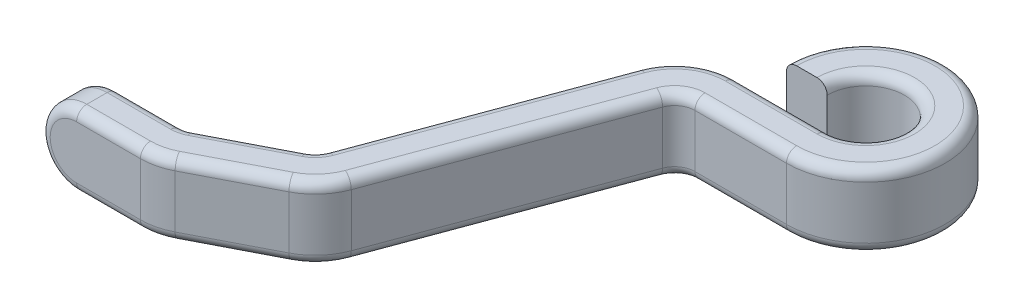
ISO-10303-21;
HEADER;
FILE_DESCRIPTION(('STEP AP214'),'2;1');
FILE_NAME('part.step','',(''),(''),'','','');
FILE_SCHEMA(('AUTOMOTIVE_DESIGN { 1 0 10303 214 1 1 1 1 }'));
ENDSEC;
DATA;
#1=APPLICATION_CONTEXT('core data for automotive mechanical design processes');
#2=APPLICATION_PROTOCOL_DEFINITION('international standard','automotive_design',2000,#1);
#3=PRODUCT_CONTEXT('',#1,'mechanical');
#4=PRODUCT('Part','Part','',(#3));
#5=PRODUCT_RELATED_PRODUCT_CATEGORY('part','',(#4));
#6=PRODUCT_DEFINITION_FORMATION('','',#4);
#7=PRODUCT_DEFINITION_CONTEXT('part definition',#1,'design');
#8=PRODUCT_DEFINITION('design','',#6,#7);
#9=PRODUCT_DEFINITION_SHAPE('','',#8);
#10=(LENGTH_UNIT() NAMED_UNIT(*) SI_UNIT(.MILLI.,.METRE.));
#11=(NAMED_UNIT(*) PLANE_ANGLE_UNIT() SI_UNIT($,.RADIAN.));
#12=(NAMED_UNIT(*) SI_UNIT($,.STERADIAN.) SOLID_ANGLE_UNIT());
#13=UNCERTAINTY_MEASURE_WITH_UNIT(LENGTH_MEASURE(1.E-05),#10,'distance_accuracy_value','');
#14=(GEOMETRIC_REPRESENTATION_CONTEXT(3) GLOBAL_UNCERTAINTY_ASSIGNED_CONTEXT((#13)) GLOBAL_UNIT_ASSIGNED_CONTEXT((#10,
#11,#12)) REPRESENTATION_CONTEXT('',''));
#15=CARTESIAN_POINT('',(0.,0.,0.));
#16=DIRECTION('',(0.,0.,1.));
#17=DIRECTION('',(1.,0.,0.));
#18=AXIS2_PLACEMENT_3D('',#15,#16,#17);
#19=CARTESIAN_POINT('',(3.9960411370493,0.,1.));
#20=DIRECTION('',(0.,0.,-1.));
#21=DIRECTION('',(-1.,0.,0.));
#22=AXIS2_PLACEMENT_3D('',#19,#20,#21);
#23=CYLINDRICAL_SURFACE('',#22,0.9);
#24=DIRECTION('',(0.,0.,-1.));
#25=VECTOR('',#24,1.);
#26=CARTESIAN_POINT('',(3.9960411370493,0.900000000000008,1.));
#27=LINE('',#26,#25);
#28=CARTESIAN_POINT('',(3.9960411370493,0.900000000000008,0.75));
#29=VERTEX_POINT('',#28);
#30=CARTESIAN_POINT('',(3.9960411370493,0.900000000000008,0.25));
#31=VERTEX_POINT('',#30);
#32=EDGE_CURVE('E550',#29,#31,#27,.T.);
#33=ORIENTED_EDGE('',*,*,#32,.T.);
#34=CARTESIAN_POINT('',(3.9960411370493,0.,0.25));
#35=DIRECTION('',(0.,0.,1.));
#36=DIRECTION('',(1.,0.,0.));
#37=AXIS2_PLACEMENT_3D('',#34,#35,#36);
#38=CIRCLE('',#37,0.9);
#39=CARTESIAN_POINT('',(3.9960411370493,-0.899999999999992,0.25));
#40=VERTEX_POINT('',#39);
#41=EDGE_CURVE('E465',#31,#40,#38,.T.);
#42=ORIENTED_EDGE('',*,*,#41,.T.);
#43=DIRECTION('',(0.,0.,-1.));
#44=VECTOR('',#43,1.);
#45=CARTESIAN_POINT('',(3.9960411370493,-0.899999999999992,1.));
#46=LINE('',#45,#44);
#47=CARTESIAN_POINT('',(3.9960411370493,-0.899999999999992,0.75));
#48=VERTEX_POINT('',#47);
#49=EDGE_CURVE('E286',#48,#40,#46,.T.);
#50=ORIENTED_EDGE('',*,*,#49,.F.);
#51=CARTESIAN_POINT('',(3.9960411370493,0.,0.75));
#52=DIRECTION('',(0.,0.,1.));
#53=DIRECTION('',(1.,0.,0.));
#54=AXIS2_PLACEMENT_3D('',#51,#52,#53);
#55=CIRCLE('',#54,0.9);
#56=EDGE_CURVE('E349',#48,#29,#55,.F.);
#57=ORIENTED_EDGE('',*,*,#56,.T.);
#58=EDGE_LOOP('',(#33,#42,#50,#57));
#59=FACE_BOUND('',#58,.T.);
#60=ADVANCED_FACE('F43',(#59),#23,.T.);
#61=CARTESIAN_POINT('',(3.9960411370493,-0.899999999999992,1.));
#62=DIRECTION('',(0.,1.,0.));
#63=DIRECTION('',(-1.,0.,0.));
#64=AXIS2_PLACEMENT_3D('',#61,#62,#63);
#65=PLANE('',#64);
#66=DIRECTION('',(1.,0.,0.));
#67=VECTOR('',#66,1.);
#68=CARTESIAN_POINT('',(13.6003112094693,-0.899999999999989,-7.59266652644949));
#69=LINE('',#68,#67);
#70=CARTESIAN_POINT('',(11.3503112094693,-0.89999999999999,-7.5926665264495));
#71=VERTEX_POINT('',#70);
#72=CARTESIAN_POINT('',(13.6003112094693,-0.899999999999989,-7.59266652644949));
#73=VERTEX_POINT('',#72);
#74=EDGE_CURVE('E423',#71,#73,#69,.T.);
#75=ORIENTED_EDGE('',*,*,#74,.T.);
#76=CARTESIAN_POINT('',(13.6003112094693,-0.899999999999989,-8.79266652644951));
#77=DIRECTION('',(0.,1.,0.));
#78=DIRECTION('',(-1.,0.,0.));
#79=AXIS2_PLACEMENT_3D('',#76,#77,#78);
#80=CIRCLE('',#79,1.20000000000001);
#81=CARTESIAN_POINT('',(12.4003112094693,-0.899999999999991,-8.7926665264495));
#82=VERTEX_POINT('',#81);
#83=EDGE_CURVE('E421',#73,#82,#80,.T.);
#84=ORIENTED_EDGE('',*,*,#83,.T.);
#85=DIRECTION('',(1.,0.,0.));
#86=VECTOR('',#85,1.);
#87=CARTESIAN_POINT('',(11.6503112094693,-0.899999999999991,-8.79266652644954));
#88=LINE('',#87,#86);
#89=CARTESIAN_POINT('',(11.9003112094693,-0.899999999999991,-8.79266652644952));
#90=VERTEX_POINT('',#89);
#91=EDGE_CURVE('E587',#90,#82,#88,.T.);
#92=ORIENTED_EDGE('',*,*,#91,.F.);
#93=CARTESIAN_POINT('',(13.6003112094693,-0.899999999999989,-8.79266652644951));
#94=DIRECTION('',(0.,1.,0.));
#95=DIRECTION('',(-1.,0.,0.));
#96=AXIS2_PLACEMENT_3D('',#93,#94,#95);
#97=CIRCLE('',#96,1.70000000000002);
#98=CARTESIAN_POINT('',(13.6003112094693,-0.899999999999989,-7.09266652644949));
#99=VERTEX_POINT('',#98);
#100=EDGE_CURVE('E316',#90,#99,#97,.F.);
#101=ORIENTED_EDGE('',*,*,#100,.T.);
#102=DIRECTION('',(1.,0.,0.));
#103=VECTOR('',#102,1.);
#104=CARTESIAN_POINT('',(11.3503112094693,-0.89999999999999,-7.09266652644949));
#105=LINE('',#104,#103);
#106=CARTESIAN_POINT('',(11.3503112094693,-0.89999999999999,-7.09266652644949));
#107=VERTEX_POINT('',#106);
#108=EDGE_CURVE('E319',#99,#107,#105,.F.);
#109=ORIENTED_EDGE('',*,*,#108,.T.);
#110=CARTESIAN_POINT('',(11.3503112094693,-0.89999999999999,-6.34266652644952));
#111=DIRECTION('',(0.,1.,0.));
#112=DIRECTION('',(-1.,0.,0.));
#113=AXIS2_PLACEMENT_3D('',#110,#111,#112);
#114=CIRCLE('',#113,0.749999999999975);
#115=CARTESIAN_POINT('',(10.6469390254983,-0.89999999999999,-6.60298857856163));
#116=VERTEX_POINT('',#115);
#117=EDGE_CURVE('E574',#107,#116,#114,.T.);
#118=ORIENTED_EDGE('',*,*,#117,.T.);
#119=DIRECTION('',(0.34709606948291,0.,-0.937829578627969));
#120=VECTOR('',#119,1.);
#121=CARTESIAN_POINT('',(8.58006257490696,-0.89999999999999,-1.01843133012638));
#122=LINE('',#121,#120);
#123=CARTESIAN_POINT('',(8.58006257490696,-0.89999999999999,-1.01843133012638));
#124=VERTEX_POINT('',#123);
#125=EDGE_CURVE('E568',#116,#124,#122,.F.);
#126=ORIENTED_EDGE('',*,*,#125,.T.);
#127=CARTESIAN_POINT('',(7.40777560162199,-0.899999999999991,-1.45230141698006));
#128=DIRECTION('',(0.,1.,0.));
#129=DIRECTION('',(-1.,0.,0.));
#130=AXIS2_PLACEMENT_3D('',#127,#128,#129);
#131=CIRCLE('',#130,1.25000000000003);
#132=CARTESIAN_POINT('',(7.98103232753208,-0.899999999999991,-0.341501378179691));
#133=VERTEX_POINT('',#132);
#134=EDGE_CURVE('E566',#124,#133,#131,.F.);
#135=ORIENTED_EDGE('',*,*,#134,.T.);
#136=DIRECTION('',(0.888640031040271,0.,-0.45860538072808));
#137=VECTOR('',#136,1.);
#138=CARTESIAN_POINT('',(6.13575707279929,-0.899999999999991,0.610800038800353));
#139=LINE('',#138,#137);
#140=CARTESIAN_POINT('',(6.13575707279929,-0.899999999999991,0.610800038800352));
#141=VERTEX_POINT('',#140);
#142=EDGE_CURVE('E567',#133,#141,#139,.F.);
#143=ORIENTED_EDGE('',*,*,#142,.T.);
#144=CARTESIAN_POINT('',(5.56250034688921,-0.899999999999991,-0.500000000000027));
#145=DIRECTION('',(0.,1.,0.));
#146=DIRECTION('',(-1.,0.,0.));
#147=AXIS2_PLACEMENT_3D('',#144,#145,#146);
#148=CIRCLE('',#147,1.25000000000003);
#149=CARTESIAN_POINT('',(5.56250034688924,-0.899999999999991,0.75));
#150=VERTEX_POINT('',#149);
#151=EDGE_CURVE('E564',#141,#150,#148,.F.);
#152=ORIENTED_EDGE('',*,*,#151,.T.);
#153=DIRECTION('',(1.,0.,0.));
#154=VECTOR('',#153,1.);
#155=CARTESIAN_POINT('',(3.9960411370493,-0.899999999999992,0.75));
#156=LINE('',#155,#154);
#157=EDGE_CURVE('E565',#150,#48,#156,.F.);
#158=ORIENTED_EDGE('',*,*,#157,.T.);
#159=ORIENTED_EDGE('',*,*,#49,.T.);
#160=DIRECTION('',(1.,0.,0.));
#161=VECTOR('',#160,1.);
#162=CARTESIAN_POINT('',(3.9960411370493,-0.899999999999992,0.25));
#163=LINE('',#162,#161);
#164=CARTESIAN_POINT('',(5.56250034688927,-0.899999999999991,0.25));
#165=VERTEX_POINT('',#164);
#166=EDGE_CURVE('E368',#40,#165,#163,.T.);
#167=ORIENTED_EDGE('',*,*,#166,.T.);
#168=CARTESIAN_POINT('',(5.56250034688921,-0.899999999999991,-0.500000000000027));
#169=DIRECTION('',(0.,1.,0.));
#170=DIRECTION('',(-1.,0.,0.));
#171=AXIS2_PLACEMENT_3D('',#168,#169,#170);
#172=CIRCLE('',#171,0.750000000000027);
#173=CARTESIAN_POINT('',(5.90645438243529,-0.899999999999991,0.166480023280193));
#174=VERTEX_POINT('',#173);
#175=EDGE_CURVE('E413',#165,#174,#172,.T.);
#176=ORIENTED_EDGE('',*,*,#175,.T.);
#177=DIRECTION('',(0.888640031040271,0.,-0.45860538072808));
#178=VECTOR('',#177,1.);
#179=CARTESIAN_POINT('',(7.75172963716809,-0.899999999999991,-0.785821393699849));
#180=LINE('',#179,#178);
#181=CARTESIAN_POINT('',(7.7517296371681,-0.899999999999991,-0.785821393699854));
#182=VERTEX_POINT('',#181);
#183=EDGE_CURVE('E411',#174,#182,#180,.T.);
#184=ORIENTED_EDGE('',*,*,#183,.T.);
#185=CARTESIAN_POINT('',(7.40777560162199,-0.899999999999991,-1.45230141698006));
#186=DIRECTION('',(0.,1.,0.));
#187=DIRECTION('',(-1.,0.,0.));
#188=AXIS2_PLACEMENT_3D('',#185,#186,#187);
#189=CIRCLE('',#188,0.750000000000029);
#190=CARTESIAN_POINT('',(8.111147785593,-0.899999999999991,-1.19197936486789));
#191=VERTEX_POINT('',#190);
#192=EDGE_CURVE('E414',#182,#191,#189,.T.);
#193=ORIENTED_EDGE('',*,*,#192,.T.);
#194=DIRECTION('',(0.34709606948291,0.,-0.937829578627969));
#195=VECTOR('',#194,1.);
#196=CARTESIAN_POINT('',(10.1780242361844,-0.89999999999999,-6.77653661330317));
#197=LINE('',#196,#195);
#198=CARTESIAN_POINT('',(10.1780242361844,-0.89999999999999,-6.77653661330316));
#199=VERTEX_POINT('',#198);
#200=EDGE_CURVE('E417',#191,#199,#197,.T.);
#201=ORIENTED_EDGE('',*,*,#200,.T.);
#202=CARTESIAN_POINT('',(11.3503112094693,-0.89999999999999,-6.34266652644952));
#203=DIRECTION('',(0.,1.,0.));
#204=DIRECTION('',(-1.,0.,0.));
#205=AXIS2_PLACEMENT_3D('',#202,#203,#204);
#206=CIRCLE('',#205,1.24999999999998);
#207=EDGE_CURVE('E420',#199,#71,#206,.F.);
#208=ORIENTED_EDGE('',*,*,#207,.T.);
#209=EDGE_LOOP('',(#75,#84,#92,#101,#109,#118,#126,#135,#143,#152,#158,#159,#167,#176,#184,#193,
#201,#208));
#210=FACE_BOUND('',#209,.T.);
#211=ADVANCED_FACE('F578',(#210),#65,.F.);
#212=CARTESIAN_POINT('',(5.3053234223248,0.900000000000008,1.));
#213=DIRECTION('',(0.,-1.,0.));
#214=DIRECTION('',(0.,0.,-1.));
#215=AXIS2_PLACEMENT_3D('',#212,#213,#214);
#216=PLANE('',#215);
#217=CARTESIAN_POINT('',(5.56250034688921,0.900000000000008,-0.500000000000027));
#218=DIRECTION('',(0.,-1.,0.));
#219=DIRECTION('',(0.,0.,-1.));
#220=AXIS2_PLACEMENT_3D('',#217,#218,#219);
#221=CIRCLE('',#220,0.750000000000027);
#222=CARTESIAN_POINT('',(5.9064543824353,0.900000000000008,0.166480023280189));
#223=VERTEX_POINT('',#222);
#224=CARTESIAN_POINT('',(5.56250034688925,0.900000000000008,0.25));
#225=VERTEX_POINT('',#224);
#226=EDGE_CURVE('E55',#223,#225,#221,.T.);
#227=ORIENTED_EDGE('',*,*,#226,.T.);
#228=DIRECTION('',(-1.,0.,0.));
#229=VECTOR('',#228,1.);
#230=CARTESIAN_POINT('',(5.3053234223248,0.900000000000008,0.25));
#231=LINE('',#230,#229);
#232=EDGE_CURVE('E11',#225,#31,#231,.T.);
#233=ORIENTED_EDGE('',*,*,#232,.T.);
#234=ORIENTED_EDGE('',*,*,#32,.F.);
#235=DIRECTION('',(-1.,0.,0.));
#236=VECTOR('',#235,1.);
#237=CARTESIAN_POINT('',(5.56250034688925,0.900000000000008,0.75));
#238=LINE('',#237,#236);
#239=CARTESIAN_POINT('',(5.56250034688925,0.900000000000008,0.75));
#240=VERTEX_POINT('',#239);
#241=EDGE_CURVE('E365',#29,#240,#238,.F.);
#242=ORIENTED_EDGE('',*,*,#241,.T.);
#243=CARTESIAN_POINT('',(5.56250034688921,0.900000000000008,-0.500000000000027));
#244=DIRECTION('',(0.,-1.,0.));
#245=DIRECTION('',(0.,0.,-1.));
#246=AXIS2_PLACEMENT_3D('',#243,#244,#245);
#247=CIRCLE('',#246,1.25000000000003);
#248=CARTESIAN_POINT('',(6.13575707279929,0.900000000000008,0.61080003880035));
#249=VERTEX_POINT('',#248);
#250=EDGE_CURVE('E362',#240,#249,#247,.F.);
#251=ORIENTED_EDGE('',*,*,#250,.T.);
#252=DIRECTION('',(0.888640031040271,0.,-0.45860538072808));
#253=VECTOR('',#252,1.);
#254=CARTESIAN_POINT('',(7.98103232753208,0.900000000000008,-0.341501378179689));
#255=LINE('',#254,#253);
#256=CARTESIAN_POINT('',(7.98103232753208,0.900000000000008,-0.341501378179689));
#257=VERTEX_POINT('',#256);
#258=EDGE_CURVE('E357',#249,#257,#255,.T.);
#259=ORIENTED_EDGE('',*,*,#258,.T.);
#260=CARTESIAN_POINT('',(7.40777560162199,0.900000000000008,-1.45230141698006));
#261=DIRECTION('',(0.,-1.,0.));
#262=DIRECTION('',(0.,0.,-1.));
#263=AXIS2_PLACEMENT_3D('',#260,#261,#262);
#264=CIRCLE('',#263,1.25000000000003);
#265=CARTESIAN_POINT('',(8.58006257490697,0.900000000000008,-1.01843133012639));
#266=VERTEX_POINT('',#265);
#267=EDGE_CURVE('E351',#257,#266,#264,.F.);
#268=ORIENTED_EDGE('',*,*,#267,.T.);
#269=DIRECTION('',(0.34709606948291,0.,-0.937829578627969));
#270=VECTOR('',#269,1.);
#271=CARTESIAN_POINT('',(10.6469390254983,0.900000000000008,-6.60298857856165));
#272=LINE('',#271,#270);
#273=CARTESIAN_POINT('',(10.6469390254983,0.900000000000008,-6.60298857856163));
#274=VERTEX_POINT('',#273);
#275=EDGE_CURVE('E353',#266,#274,#272,.T.);
#276=ORIENTED_EDGE('',*,*,#275,.T.);
#277=CARTESIAN_POINT('',(11.3503112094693,0.900000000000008,-6.34266652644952));
#278=DIRECTION('',(0.,-1.,0.));
#279=DIRECTION('',(0.,0.,-1.));
#280=AXIS2_PLACEMENT_3D('',#277,#278,#279);
#281=CIRCLE('',#280,0.749999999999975);
#282=CARTESIAN_POINT('',(11.3503112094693,0.900000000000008,-7.09266652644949));
#283=VERTEX_POINT('',#282);
#284=EDGE_CURVE('E352',#274,#283,#281,.T.);
#285=ORIENTED_EDGE('',*,*,#284,.T.);
#286=DIRECTION('',(1.,0.,0.));
#287=VECTOR('',#286,1.);
#288=CARTESIAN_POINT('',(13.6003112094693,0.900000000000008,-7.09266652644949));
#289=LINE('',#288,#287);
#290=CARTESIAN_POINT('',(13.6003112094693,0.900000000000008,-7.09266652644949));
#291=VERTEX_POINT('',#290);
#292=EDGE_CURVE('E360',#283,#291,#289,.T.);
#293=ORIENTED_EDGE('',*,*,#292,.T.);
#294=CARTESIAN_POINT('',(13.6003112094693,0.900000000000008,-8.79266652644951));
#295=DIRECTION('',(0.,-1.,0.));
#296=DIRECTION('',(0.,0.,-1.));
#297=AXIS2_PLACEMENT_3D('',#294,#295,#296);
#298=CIRCLE('',#297,1.70000000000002);
#299=CARTESIAN_POINT('',(11.9003112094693,0.900000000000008,-8.79266652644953));
#300=VERTEX_POINT('',#299);
#301=EDGE_CURVE('E308',#291,#300,#298,.F.);
#302=ORIENTED_EDGE('',*,*,#301,.T.);
#303=DIRECTION('',(-1.,0.,0.));
#304=VECTOR('',#303,1.);
#305=CARTESIAN_POINT('',(12.6503112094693,0.900000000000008,-8.79266652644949));
#306=LINE('',#305,#304);
#307=CARTESIAN_POINT('',(12.4003112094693,0.900000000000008,-8.7926665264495));
#308=VERTEX_POINT('',#307);
#309=EDGE_CURVE('E547',#308,#300,#306,.T.);
#310=ORIENTED_EDGE('',*,*,#309,.F.);
#311=CARTESIAN_POINT('',(13.6003112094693,0.900000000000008,-8.79266652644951));
#312=DIRECTION('',(0.,-1.,0.));
#313=DIRECTION('',(0.,0.,-1.));
#314=AXIS2_PLACEMENT_3D('',#311,#312,#313);
#315=CIRCLE('',#314,1.20000000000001);
#316=CARTESIAN_POINT('',(13.6003112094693,0.900000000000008,-7.59266652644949));
#317=VERTEX_POINT('',#316);
#318=EDGE_CURVE('E474',#308,#317,#315,.T.);
#319=ORIENTED_EDGE('',*,*,#318,.T.);
#320=DIRECTION('',(1.,0.,0.));
#321=VECTOR('',#320,1.);
#322=CARTESIAN_POINT('',(11.3503112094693,0.900000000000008,-7.59266652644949));
#323=LINE('',#322,#321);
#324=CARTESIAN_POINT('',(11.3503112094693,0.900000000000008,-7.5926665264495));
#325=VERTEX_POINT('',#324);
#326=EDGE_CURVE('E472',#317,#325,#323,.F.);
#327=ORIENTED_EDGE('',*,*,#326,.T.);
#328=CARTESIAN_POINT('',(11.3503112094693,0.900000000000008,-6.34266652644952));
#329=DIRECTION('',(0.,-1.,0.));
#330=DIRECTION('',(0.,0.,-1.));
#331=AXIS2_PLACEMENT_3D('',#328,#329,#330);
#332=CIRCLE('',#331,1.24999999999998);
#333=CARTESIAN_POINT('',(10.1780242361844,0.900000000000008,-6.77653661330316));
#334=VERTEX_POINT('',#333);
#335=EDGE_CURVE('E466',#325,#334,#332,.F.);
#336=ORIENTED_EDGE('',*,*,#335,.T.);
#337=DIRECTION('',(0.34709606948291,0.,-0.937829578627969));
#338=VECTOR('',#337,1.);
#339=CARTESIAN_POINT('',(8.111147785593,0.900000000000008,-1.19197936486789));
#340=LINE('',#339,#338);
#341=CARTESIAN_POINT('',(8.111147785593,0.900000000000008,-1.1919793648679));
#342=VERTEX_POINT('',#341);
#343=EDGE_CURVE('E468',#334,#342,#340,.F.);
#344=ORIENTED_EDGE('',*,*,#343,.T.);
#345=CARTESIAN_POINT('',(7.40777560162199,0.900000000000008,-1.45230141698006));
#346=DIRECTION('',(0.,-1.,0.));
#347=DIRECTION('',(0.,0.,-1.));
#348=AXIS2_PLACEMENT_3D('',#345,#346,#347);
#349=CIRCLE('',#348,0.750000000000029);
#350=CARTESIAN_POINT('',(7.75172963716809,0.900000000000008,-0.785821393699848));
#351=VERTEX_POINT('',#350);
#352=EDGE_CURVE('E469',#342,#351,#349,.T.);
#353=ORIENTED_EDGE('',*,*,#352,.T.);
#354=DIRECTION('',(0.888640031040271,0.,-0.45860538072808));
#355=VECTOR('',#354,1.);
#356=CARTESIAN_POINT('',(5.90645438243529,0.900000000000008,0.166480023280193));
#357=LINE('',#356,#355);
#358=EDGE_CURVE('E64',#351,#223,#357,.F.);
#359=ORIENTED_EDGE('',*,*,#358,.T.);
#360=EDGE_LOOP('',(#227,#233,#234,#242,#251,#259,#268,#276,#285,#293,#302,#310,#319,#327,#336,
#344,#353,#359));
#361=FACE_BOUND('',#360,.T.);
#362=ADVANCED_FACE('F641',(#361),#216,.F.);
#363=CARTESIAN_POINT('',(3.9960411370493,0.,1.));
#364=DIRECTION('',(0.,0.,1.));
#365=DIRECTION('',(1.,0.,0.));
#366=AXIS2_PLACEMENT_3D('',#363,#364,#365);
#367=PLANE('',#366);
#368=CARTESIAN_POINT('',(3.9960411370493,0.,1.));
#369=DIRECTION('',(0.,0.,1.));
#370=DIRECTION('',(1.,0.,0.));
#371=AXIS2_PLACEMENT_3D('',#368,#369,#370);
#372=CIRCLE('',#371,0.65);
#373=CARTESIAN_POINT('',(3.9960411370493,0.650000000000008,1.));
#374=VERTEX_POINT('',#373);
#375=CARTESIAN_POINT('',(3.9960411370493,-0.649999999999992,1.));
#376=VERTEX_POINT('',#375);
#377=EDGE_CURVE('E342',#374,#376,#372,.T.);
#378=ORIENTED_EDGE('',*,*,#377,.T.);
#379=DIRECTION('',(1.,0.,0.));
#380=VECTOR('',#379,1.);
#381=CARTESIAN_POINT('',(5.56250034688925,-0.649999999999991,1.));
#382=LINE('',#381,#380);
#383=CARTESIAN_POINT('',(5.56250034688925,-0.649999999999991,1.));
#384=VERTEX_POINT('',#383);
#385=EDGE_CURVE('E350',#376,#384,#382,.T.);
#386=ORIENTED_EDGE('',*,*,#385,.T.);
#387=DIRECTION('',(0.,-1.,0.));
#388=VECTOR('',#387,1.);
#389=CARTESIAN_POINT('',(5.56250034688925,0.900000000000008,1.));
#390=LINE('',#389,#388);
#391=CARTESIAN_POINT('',(5.56250034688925,0.650000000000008,1.));
#392=VERTEX_POINT('',#391);
#393=EDGE_CURVE('E625',#392,#384,#390,.T.);
#394=ORIENTED_EDGE('',*,*,#393,.F.);
#395=DIRECTION('',(-1.,0.,0.));
#396=VECTOR('',#395,1.);
#397=CARTESIAN_POINT('',(3.9960411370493,0.650000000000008,1.));
#398=LINE('',#397,#396);
#399=EDGE_CURVE('E341',#392,#374,#398,.T.);
#400=ORIENTED_EDGE('',*,*,#399,.T.);
#401=EDGE_LOOP('',(#378,#386,#394,#400));
#402=FACE_BOUND('',#401,.T.);
#403=ADVANCED_FACE('F662',(#402),#367,.T.);
#404=CARTESIAN_POINT('',(3.9960411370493,0.,0.));
#405=DIRECTION('',(0.,0.,1.));
#406=DIRECTION('',(1.,0.,0.));
#407=AXIS2_PLACEMENT_3D('',#404,#405,#406);
#408=PLANE('',#407);
#409=DIRECTION('',(0.,1.,0.));
#410=VECTOR('',#409,1.);
#411=CARTESIAN_POINT('',(5.56250034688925,-0.899999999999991,0.));
#412=LINE('',#411,#410);
#413=CARTESIAN_POINT('',(5.56250034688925,-0.649999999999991,0.));
#414=VERTEX_POINT('',#413);
#415=CARTESIAN_POINT('',(5.56250034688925,0.650000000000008,0.));
#416=VERTEX_POINT('',#415);
#417=EDGE_CURVE('E310',#414,#416,#412,.T.);
#418=ORIENTED_EDGE('',*,*,#417,.F.);
#419=DIRECTION('',(1.,0.,0.));
#420=VECTOR('',#419,1.);
#421=CARTESIAN_POINT('',(3.9960411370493,-0.649999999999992,0.));
#422=LINE('',#421,#420);
#423=CARTESIAN_POINT('',(3.9960411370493,-0.649999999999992,0.));
#424=VERTEX_POINT('',#423);
#425=EDGE_CURVE('E464',#414,#424,#422,.F.);
#426=ORIENTED_EDGE('',*,*,#425,.T.);
#427=CARTESIAN_POINT('',(3.9960411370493,0.,0.));
#428=DIRECTION('',(0.,0.,1.));
#429=DIRECTION('',(1.,0.,0.));
#430=AXIS2_PLACEMENT_3D('',#427,#428,#429);
#431=CIRCLE('',#430,0.65);
#432=CARTESIAN_POINT('',(3.9960411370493,0.650000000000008,0.));
#433=VERTEX_POINT('',#432);
#434=EDGE_CURVE('E458',#424,#433,#431,.F.);
#435=ORIENTED_EDGE('',*,*,#434,.T.);
#436=DIRECTION('',(-1.,0.,0.));
#437=VECTOR('',#436,1.);
#438=CARTESIAN_POINT('',(3.9960411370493,0.650000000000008,0.));
#439=LINE('',#438,#437);
#440=EDGE_CURVE('E456',#433,#416,#439,.F.);
#441=ORIENTED_EDGE('',*,*,#440,.T.);
#442=EDGE_LOOP('',(#418,#426,#435,#441));
#443=FACE_BOUND('',#442,.T.);
#444=ADVANCED_FACE('F736',(#443),#408,.F.);
#445=CARTESIAN_POINT('',(13.6003112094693,0.,-8.79266652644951));
#446=DIRECTION('',(0.,1.,0.));
#447=DIRECTION('',(0.,0.,1.));
#448=AXIS2_PLACEMENT_3D('',#445,#446,#447);
#449=CYLINDRICAL_SURFACE('',#448,0.950000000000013);
#450=DIRECTION('',(0.,1.,0.));
#451=VECTOR('',#450,1.);
#452=CARTESIAN_POINT('',(12.6503112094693,-0.899999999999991,-8.79266652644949));
#453=LINE('',#452,#451);
#454=CARTESIAN_POINT('',(12.6503112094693,-0.649999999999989,-8.79266652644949));
#455=VERTEX_POINT('',#454);
#456=CARTESIAN_POINT('',(12.6503112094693,0.650000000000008,-8.79266652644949));
#457=VERTEX_POINT('',#456);
#458=EDGE_CURVE('E539',#455,#457,#453,.T.);
#459=ORIENTED_EDGE('',*,*,#458,.F.);
#460=CARTESIAN_POINT('',(13.6003112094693,-0.649999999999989,-8.79266652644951));
#461=DIRECTION('',(0.,1.,0.));
#462=DIRECTION('',(-1.,0.,0.));
#463=AXIS2_PLACEMENT_3D('',#460,#461,#462);
#464=CIRCLE('',#463,0.950000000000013);
#465=CARTESIAN_POINT('',(13.6003112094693,-0.649999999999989,-7.84266652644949));
#466=VERTEX_POINT('',#465);
#467=EDGE_CURVE('E435',#455,#466,#464,.F.);
#468=ORIENTED_EDGE('',*,*,#467,.T.);
#469=DIRECTION('',(0.,1.,0.));
#470=VECTOR('',#469,1.);
#471=CARTESIAN_POINT('',(13.6003112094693,-0.899999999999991,-7.84266652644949));
#472=LINE('',#471,#470);
#473=CARTESIAN_POINT('',(13.6003112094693,0.650000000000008,-7.84266652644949));
#474=VERTEX_POINT('',#473);
#475=EDGE_CURVE('E297',#466,#474,#472,.T.);
#476=ORIENTED_EDGE('',*,*,#475,.T.);
#477=CARTESIAN_POINT('',(13.6003112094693,0.650000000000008,-8.79266652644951));
#478=DIRECTION('',(0.,-1.,0.));
#479=DIRECTION('',(0.,0.,-1.));
#480=AXIS2_PLACEMENT_3D('',#477,#478,#479);
#481=CIRCLE('',#480,0.950000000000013);
#482=EDGE_CURVE('E429',#474,#457,#481,.F.);
#483=ORIENTED_EDGE('',*,*,#482,.T.);
#484=EDGE_LOOP('',(#459,#468,#476,#483));
#485=FACE_BOUND('',#484,.T.);
#486=ADVANCED_FACE('F537',(#485),#449,.F.);
#487=CARTESIAN_POINT('',(13.6003112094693,0.,-8.79266652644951));
#488=DIRECTION('',(0.,1.,0.));
#489=DIRECTION('',(0.,0.,1.));
#490=AXIS2_PLACEMENT_3D('',#487,#488,#489);
#491=CYLINDRICAL_SURFACE('',#490,1.95000000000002);
#492=DIRECTION('',(0.,-1.,0.));
#493=VECTOR('',#492,1.);
#494=CARTESIAN_POINT('',(13.6003112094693,0.900000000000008,-6.84266652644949));
#495=LINE('',#494,#493);
#496=CARTESIAN_POINT('',(13.6003112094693,0.650000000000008,-6.84266652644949));
#497=VERTEX_POINT('',#496);
#498=CARTESIAN_POINT('',(13.6003112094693,-0.649999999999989,-6.84266652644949));
#499=VERTEX_POINT('',#498);
#500=EDGE_CURVE('E278',#497,#499,#495,.T.);
#501=ORIENTED_EDGE('',*,*,#500,.T.);
#502=CARTESIAN_POINT('',(13.6003112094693,-0.649999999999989,-8.79266652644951));
#503=DIRECTION('',(0.,1.,0.));
#504=DIRECTION('',(-1.,0.,0.));
#505=AXIS2_PLACEMENT_3D('',#502,#503,#504);
#506=CIRCLE('',#505,1.95000000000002);
#507=CARTESIAN_POINT('',(11.6503112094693,-0.649999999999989,-8.79266652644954));
#508=VERTEX_POINT('',#507);
#509=EDGE_CURVE('E290',#499,#508,#506,.T.);
#510=ORIENTED_EDGE('',*,*,#509,.T.);
#511=DIRECTION('',(0.,-1.,0.));
#512=VECTOR('',#511,1.);
#513=CARTESIAN_POINT('',(11.6503112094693,0.900000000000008,-8.79266652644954));
#514=LINE('',#513,#512);
#515=CARTESIAN_POINT('',(11.6503112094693,0.650000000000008,-8.79266652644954));
#516=VERTEX_POINT('',#515);
#517=EDGE_CURVE('E284',#516,#508,#514,.T.);
#518=ORIENTED_EDGE('',*,*,#517,.F.);
#519=CARTESIAN_POINT('',(13.6003112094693,0.650000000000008,-8.79266652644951));
#520=DIRECTION('',(0.,-1.,0.));
#521=DIRECTION('',(0.,0.,-1.));
#522=AXIS2_PLACEMENT_3D('',#519,#520,#521);
#523=CIRCLE('',#522,1.95000000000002);
#524=EDGE_CURVE('E277',#516,#497,#523,.T.);
#525=ORIENTED_EDGE('',*,*,#524,.T.);
#526=EDGE_LOOP('',(#501,#510,#518,#525));
#527=FACE_BOUND('',#526,.T.);
#528=ADVANCED_FACE('F279',(#527),#491,.T.);
#529=CARTESIAN_POINT('',(11.3503112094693,-0.899999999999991,-7.84266652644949));
#530=DIRECTION('',(0.,0.,-1.));
#531=DIRECTION('',(-1.,0.,0.));
#532=AXIS2_PLACEMENT_3D('',#529,#530,#531);
#533=PLANE('',#532);
#534=ORIENTED_EDGE('',*,*,#475,.F.);
#535=DIRECTION('',(1.,0.,0.));
#536=VECTOR('',#535,1.);
#537=CARTESIAN_POINT('',(11.3503112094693,-0.64999999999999,-7.84266652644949));
#538=LINE('',#537,#536);
#539=CARTESIAN_POINT('',(11.3503112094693,-0.649999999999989,-7.84266652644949));
#540=VERTEX_POINT('',#539);
#541=EDGE_CURVE('E436',#466,#540,#538,.F.);
#542=ORIENTED_EDGE('',*,*,#541,.T.);
#543=DIRECTION('',(0.,1.,0.));
#544=VECTOR('',#543,1.);
#545=CARTESIAN_POINT('',(11.3503112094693,-0.899999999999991,-7.84266652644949));
#546=LINE('',#545,#544);
#547=CARTESIAN_POINT('',(11.3503112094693,0.650000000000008,-7.84266652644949));
#548=VERTEX_POINT('',#547);
#549=EDGE_CURVE('E300',#540,#548,#546,.T.);
#550=ORIENTED_EDGE('',*,*,#549,.T.);
#551=DIRECTION('',(1.,0.,0.));
#552=VECTOR('',#551,1.);
#553=CARTESIAN_POINT('',(13.6003112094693,0.650000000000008,-7.84266652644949));
#554=LINE('',#553,#552);
#555=EDGE_CURVE('E432',#548,#474,#554,.T.);
#556=ORIENTED_EDGE('',*,*,#555,.T.);
#557=EDGE_LOOP('',(#534,#542,#550,#556));
#558=FACE_BOUND('',#557,.T.);
#559=ADVANCED_FACE('F1056',(#558),#533,.T.);
#560=CARTESIAN_POINT('',(11.3503112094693,0.900000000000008,-6.84266652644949));
#561=DIRECTION('',(0.,0.,1.));
#562=DIRECTION('',(1.,0.,0.));
#563=AXIS2_PLACEMENT_3D('',#560,#561,#562);
#564=PLANE('',#563);
#565=DIRECTION('',(0.,-1.,0.));
#566=VECTOR('',#565,1.);
#567=CARTESIAN_POINT('',(11.3503112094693,0.900000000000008,-6.84266652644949));
#568=LINE('',#567,#566);
#569=CARTESIAN_POINT('',(11.3503112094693,0.650000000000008,-6.84266652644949));
#570=VERTEX_POINT('',#569);
#571=CARTESIAN_POINT('',(11.3503112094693,-0.64999999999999,-6.84266652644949));
#572=VERTEX_POINT('',#571);
#573=EDGE_CURVE('E596',#570,#572,#568,.T.);
#574=ORIENTED_EDGE('',*,*,#573,.T.);
#575=DIRECTION('',(1.,0.,0.));
#576=VECTOR('',#575,1.);
#577=CARTESIAN_POINT('',(13.6003112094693,-0.649999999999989,-6.84266652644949));
#578=LINE('',#577,#576);
#579=EDGE_CURVE('E299',#572,#499,#578,.T.);
#580=ORIENTED_EDGE('',*,*,#579,.T.);
#581=ORIENTED_EDGE('',*,*,#500,.F.);
#582=DIRECTION('',(1.,0.,0.));
#583=VECTOR('',#582,1.);
#584=CARTESIAN_POINT('',(11.3503112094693,0.650000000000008,-6.84266652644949));
#585=LINE('',#584,#583);
#586=EDGE_CURVE('E294',#497,#570,#585,.F.);
#587=ORIENTED_EDGE('',*,*,#586,.T.);
#588=EDGE_LOOP('',(#574,#580,#581,#587));
#589=FACE_BOUND('',#588,.T.);
#590=ADVANCED_FACE('F295',(#589),#564,.T.);
#591=CARTESIAN_POINT('',(11.3503112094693,0.,-6.34266652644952));
#592=DIRECTION('',(0.,-1.,0.));
#593=DIRECTION('',(0.,0.,-1.));
#594=AXIS2_PLACEMENT_3D('',#591,#592,#593);
#595=CYLINDRICAL_SURFACE('',#594,1.49999999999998);
#596=ORIENTED_EDGE('',*,*,#549,.F.);
#597=CARTESIAN_POINT('',(11.3503112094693,-0.649999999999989,-6.34266652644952));
#598=DIRECTION('',(0.,1.,0.));
#599=DIRECTION('',(-1.,0.,0.));
#600=AXIS2_PLACEMENT_3D('',#597,#598,#599);
#601=CIRCLE('',#600,1.49999999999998);
#602=CARTESIAN_POINT('',(9.94356684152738,-0.64999999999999,-6.86331063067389));
#603=VERTEX_POINT('',#602);
#604=EDGE_CURVE('E439',#540,#603,#601,.T.);
#605=ORIENTED_EDGE('',*,*,#604,.T.);
#606=DIRECTION('',(0.,1.,0.));
#607=VECTOR('',#606,1.);
#608=CARTESIAN_POINT('',(9.94356684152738,-0.899999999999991,-6.86331063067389));
#609=LINE('',#608,#607);
#610=CARTESIAN_POINT('',(9.94356684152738,0.650000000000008,-6.86331063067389));
#611=VERTEX_POINT('',#610);
#612=EDGE_CURVE('E598',#603,#611,#609,.T.);
#613=ORIENTED_EDGE('',*,*,#612,.T.);
#614=CARTESIAN_POINT('',(11.3503112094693,0.650000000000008,-6.34266652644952));
#615=DIRECTION('',(0.,-1.,0.));
#616=DIRECTION('',(0.,0.,-1.));
#617=AXIS2_PLACEMENT_3D('',#614,#615,#616);
#618=CIRCLE('',#617,1.49999999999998);
#619=EDGE_CURVE('E437',#611,#548,#618,.T.);
#620=ORIENTED_EDGE('',*,*,#619,.T.);
#621=EDGE_LOOP('',(#596,#605,#613,#620));
#622=FACE_BOUND('',#621,.T.);
#623=ADVANCED_FACE('F1042',(#622),#595,.T.);
#624=CARTESIAN_POINT('',(11.3503112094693,0.,-6.34266652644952));
#625=DIRECTION('',(0.,-1.,0.));
#626=DIRECTION('',(0.,0.,-1.));
#627=AXIS2_PLACEMENT_3D('',#624,#625,#626);
#628=CYLINDRICAL_SURFACE('',#627,0.499999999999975);
#629=DIRECTION('',(0.,-1.,0.));
#630=VECTOR('',#629,1.);
#631=CARTESIAN_POINT('',(10.8813964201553,0.900000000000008,-6.51621456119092));
#632=LINE('',#631,#630);
#633=CARTESIAN_POINT('',(10.8813964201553,0.650000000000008,-6.51621456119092));
#634=VERTEX_POINT('',#633);
#635=CARTESIAN_POINT('',(10.8813964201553,-0.64999999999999,-6.51621456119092));
#636=VERTEX_POINT('',#635);
#637=EDGE_CURVE('E601',#634,#636,#632,.T.);
#638=ORIENTED_EDGE('',*,*,#637,.T.);
#639=CARTESIAN_POINT('',(11.3503112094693,-0.64999999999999,-6.34266652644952));
#640=DIRECTION('',(0.,1.,0.));
#641=DIRECTION('',(-1.,0.,0.));
#642=AXIS2_PLACEMENT_3D('',#639,#640,#641);
#643=CIRCLE('',#642,0.499999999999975);
#644=EDGE_CURVE('E324',#636,#572,#643,.F.);
#645=ORIENTED_EDGE('',*,*,#644,.T.);
#646=ORIENTED_EDGE('',*,*,#573,.F.);
#647=CARTESIAN_POINT('',(11.3503112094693,0.650000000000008,-6.34266652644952));
#648=DIRECTION('',(0.,-1.,0.));
#649=DIRECTION('',(0.,0.,-1.));
#650=AXIS2_PLACEMENT_3D('',#647,#648,#649);
#651=CIRCLE('',#650,0.499999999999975);
#652=EDGE_CURVE('E318',#570,#634,#651,.F.);
#653=ORIENTED_EDGE('',*,*,#652,.T.);
#654=EDGE_LOOP('',(#638,#645,#646,#653));
#655=FACE_BOUND('',#654,.T.);
#656=ADVANCED_FACE('F1034',(#655),#628,.F.);
#657=CARTESIAN_POINT('',(7.87669039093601,-0.899999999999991,-1.27875338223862));
#658=DIRECTION('',(-0.937829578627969,0.,-0.34709606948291));
#659=DIRECTION('',(-0.34709606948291,0.,0.937829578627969));
#660=AXIS2_PLACEMENT_3D('',#657,#658,#659);
#661=PLANE('',#660);
#662=ORIENTED_EDGE('',*,*,#612,.F.);
#663=DIRECTION('',(0.34709606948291,0.,-0.937829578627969));
#664=VECTOR('',#663,1.);
#665=CARTESIAN_POINT('',(7.87669039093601,-0.649999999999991,-1.27875338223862));
#666=LINE('',#665,#664);
#667=CARTESIAN_POINT('',(7.87669039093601,-0.649999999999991,-1.27875338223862));
#668=VERTEX_POINT('',#667);
#669=EDGE_CURVE('E441',#603,#668,#666,.F.);
#670=ORIENTED_EDGE('',*,*,#669,.T.);
#671=DIRECTION('',(0.,1.,0.));
#672=VECTOR('',#671,1.);
#673=CARTESIAN_POINT('',(7.87669039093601,-0.899999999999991,-1.27875338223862));
#674=LINE('',#673,#672);
#675=CARTESIAN_POINT('',(7.87669039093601,0.650000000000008,-1.27875338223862));
#676=VERTEX_POINT('',#675);
#677=EDGE_CURVE('E603',#668,#676,#674,.T.);
#678=ORIENTED_EDGE('',*,*,#677,.T.);
#679=DIRECTION('',(0.34709606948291,0.,-0.937829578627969));
#680=VECTOR('',#679,1.);
#681=CARTESIAN_POINT('',(9.94356684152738,0.650000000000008,-6.86331063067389));
#682=LINE('',#681,#680);
#683=EDGE_CURVE('E445',#676,#611,#682,.T.);
#684=ORIENTED_EDGE('',*,*,#683,.T.);
#685=EDGE_LOOP('',(#662,#670,#678,#684));
#686=FACE_BOUND('',#685,.T.);
#687=ADVANCED_FACE('F1030',(#686),#661,.T.);
#688=CARTESIAN_POINT('',(8.81451996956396,0.900000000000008,-0.931657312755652));
#689=DIRECTION('',(0.937829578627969,0.,0.34709606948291));
#690=DIRECTION('',(0.34709606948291,0.,-0.937829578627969));
#691=AXIS2_PLACEMENT_3D('',#688,#689,#690);
#692=PLANE('',#691);
#693=DIRECTION('',(0.,-1.,0.));
#694=VECTOR('',#693,1.);
#695=CARTESIAN_POINT('',(8.81451996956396,0.900000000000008,-0.931657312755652));
#696=LINE('',#695,#694);
#697=CARTESIAN_POINT('',(8.81451996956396,0.650000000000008,-0.931657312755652));
#698=VERTEX_POINT('',#697);
#699=CARTESIAN_POINT('',(8.81451996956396,-0.64999999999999,-0.931657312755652));
#700=VERTEX_POINT('',#699);
#701=EDGE_CURVE('E610',#698,#700,#696,.T.);
#702=ORIENTED_EDGE('',*,*,#701,.T.);
#703=DIRECTION('',(0.34709606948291,0.,-0.937829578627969));
#704=VECTOR('',#703,1.);
#705=CARTESIAN_POINT('',(10.8813964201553,-0.64999999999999,-6.51621456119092));
#706=LINE('',#705,#704);
#707=EDGE_CURVE('E328',#700,#636,#706,.T.);
#708=ORIENTED_EDGE('',*,*,#707,.T.);
#709=ORIENTED_EDGE('',*,*,#637,.F.);
#710=DIRECTION('',(0.34709606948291,0.,-0.937829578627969));
#711=VECTOR('',#710,1.);
#712=CARTESIAN_POINT('',(8.81451996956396,0.650000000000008,-0.931657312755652));
#713=LINE('',#712,#711);
#714=EDGE_CURVE('E330',#634,#698,#713,.F.);
#715=ORIENTED_EDGE('',*,*,#714,.T.);
#716=EDGE_LOOP('',(#702,#708,#709,#715));
#717=FACE_BOUND('',#716,.T.);
#718=ADVANCED_FACE('F1019',(#717),#692,.T.);
#719=CARTESIAN_POINT('',(7.40777560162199,0.,-1.45230141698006));
#720=DIRECTION('',(0.,1.,0.));
#721=DIRECTION('',(0.,0.,1.));
#722=AXIS2_PLACEMENT_3D('',#719,#720,#721);
#723=CYLINDRICAL_SURFACE('',#722,0.500000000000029);
#724=ORIENTED_EDGE('',*,*,#677,.F.);
#725=CARTESIAN_POINT('',(7.40777560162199,-0.649999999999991,-1.45230141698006));
#726=DIRECTION('',(0.,1.,0.));
#727=DIRECTION('',(-1.,0.,0.));
#728=AXIS2_PLACEMENT_3D('',#725,#726,#727);
#729=CIRCLE('',#728,0.500000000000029);
#730=CARTESIAN_POINT('',(7.63707829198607,-0.649999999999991,-1.00798140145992));
#731=VERTEX_POINT('',#730);
#732=EDGE_CURVE('E449',#668,#731,#729,.F.);
#733=ORIENTED_EDGE('',*,*,#732,.T.);
#734=DIRECTION('',(0.,1.,0.));
#735=VECTOR('',#734,1.);
#736=CARTESIAN_POINT('',(7.63707829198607,-0.899999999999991,-1.00798140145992));
#737=LINE('',#736,#735);
#738=CARTESIAN_POINT('',(7.63707829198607,0.650000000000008,-1.00798140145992));
#739=VERTEX_POINT('',#738);
#740=EDGE_CURVE('E608',#731,#739,#737,.T.);
#741=ORIENTED_EDGE('',*,*,#740,.T.);
#742=CARTESIAN_POINT('',(7.40777560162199,0.650000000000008,-1.45230141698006));
#743=DIRECTION('',(0.,-1.,0.));
#744=DIRECTION('',(0.,0.,-1.));
#745=AXIS2_PLACEMENT_3D('',#742,#743,#744);
#746=CIRCLE('',#745,0.500000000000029);
#747=EDGE_CURVE('E446',#739,#676,#746,.F.);
#748=ORIENTED_EDGE('',*,*,#747,.T.);
#749=EDGE_LOOP('',(#724,#733,#741,#748));
#750=FACE_BOUND('',#749,.T.);
#751=ADVANCED_FACE('F712',(#750),#723,.F.);
#752=CARTESIAN_POINT('',(7.40777560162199,0.,-1.45230141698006));
#753=DIRECTION('',(0.,1.,0.));
#754=DIRECTION('',(0.,0.,1.));
#755=AXIS2_PLACEMENT_3D('',#752,#753,#754);
#756=CYLINDRICAL_SURFACE('',#755,1.50000000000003);
#757=DIRECTION('',(0.,-1.,0.));
#758=VECTOR('',#757,1.);
#759=CARTESIAN_POINT('',(8.0956836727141,0.900000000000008,-0.119341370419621));
#760=LINE('',#759,#758);
#761=CARTESIAN_POINT('',(8.0956836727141,0.650000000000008,-0.119341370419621));
#762=VERTEX_POINT('',#761);
#763=CARTESIAN_POINT('',(8.0956836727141,-0.649999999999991,-0.119341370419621));
#764=VERTEX_POINT('',#763);
#765=EDGE_CURVE('E614',#762,#764,#760,.T.);
#766=ORIENTED_EDGE('',*,*,#765,.T.);
#767=CARTESIAN_POINT('',(7.40777560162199,-0.649999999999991,-1.45230141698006));
#768=DIRECTION('',(0.,1.,0.));
#769=DIRECTION('',(-1.,0.,0.));
#770=AXIS2_PLACEMENT_3D('',#767,#768,#769);
#771=CIRCLE('',#770,1.50000000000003);
#772=EDGE_CURVE('E334',#764,#700,#771,.T.);
#773=ORIENTED_EDGE('',*,*,#772,.T.);
#774=ORIENTED_EDGE('',*,*,#701,.F.);
#775=CARTESIAN_POINT('',(7.40777560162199,0.650000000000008,-1.45230141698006));
#776=DIRECTION('',(0.,-1.,0.));
#777=DIRECTION('',(0.,0.,-1.));
#778=AXIS2_PLACEMENT_3D('',#775,#776,#777);
#779=CIRCLE('',#778,1.50000000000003);
#780=EDGE_CURVE('E332',#698,#762,#779,.T.);
#781=ORIENTED_EDGE('',*,*,#780,.T.);
#782=EDGE_LOOP('',(#766,#773,#774,#781));
#783=FACE_BOUND('',#782,.T.);
#784=ADVANCED_FACE('F1007',(#783),#756,.T.);
#785=CARTESIAN_POINT('',(5.79180303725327,-0.899999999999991,-0.0556799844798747));
#786=DIRECTION('',(-0.45860538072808,0.,-0.888640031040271));
#787=DIRECTION('',(-0.888640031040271,0.,0.45860538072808));
#788=AXIS2_PLACEMENT_3D('',#785,#786,#787);
#789=PLANE('',#788);
#790=ORIENTED_EDGE('',*,*,#740,.F.);
#791=DIRECTION('',(0.888640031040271,0.,-0.45860538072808));
#792=VECTOR('',#791,1.);
#793=CARTESIAN_POINT('',(5.79180303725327,-0.649999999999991,-0.0556799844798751));
#794=LINE('',#793,#792);
#795=CARTESIAN_POINT('',(5.79180303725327,-0.649999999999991,-0.0556799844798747));
#796=VERTEX_POINT('',#795);
#797=EDGE_CURVE('E455',#731,#796,#794,.F.);
#798=ORIENTED_EDGE('',*,*,#797,.T.);
#799=DIRECTION('',(0.,1.,0.));
#800=VECTOR('',#799,1.);
#801=CARTESIAN_POINT('',(5.79180303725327,-0.899999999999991,-0.0556799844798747));
#802=LINE('',#801,#800);
#803=CARTESIAN_POINT('',(5.79180303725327,0.650000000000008,-0.0556799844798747));
#804=VERTEX_POINT('',#803);
#805=EDGE_CURVE('E618',#796,#804,#802,.T.);
#806=ORIENTED_EDGE('',*,*,#805,.T.);
#807=DIRECTION('',(0.888640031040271,0.,-0.45860538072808));
#808=VECTOR('',#807,1.);
#809=CARTESIAN_POINT('',(7.63707829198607,0.650000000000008,-1.00798140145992));
#810=LINE('',#809,#808);
#811=EDGE_CURVE('E450',#804,#739,#810,.T.);
#812=ORIENTED_EDGE('',*,*,#811,.T.);
#813=EDGE_LOOP('',(#790,#798,#806,#812));
#814=FACE_BOUND('',#813,.T.);
#815=ADVANCED_FACE('F707',(#814),#789,.T.);
#816=CARTESIAN_POINT('',(6.2504084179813,0.900000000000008,0.83296004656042));
#817=DIRECTION('',(0.45860538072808,0.,0.888640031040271));
#818=DIRECTION('',(0.888640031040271,0.,-0.45860538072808));
#819=AXIS2_PLACEMENT_3D('',#816,#817,#818);
#820=PLANE('',#819);
#821=DIRECTION('',(0.,-1.,0.));
#822=VECTOR('',#821,1.);
#823=CARTESIAN_POINT('',(6.2504084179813,0.900000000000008,0.83296004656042));
#824=LINE('',#823,#822);
#825=CARTESIAN_POINT('',(6.2504084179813,0.650000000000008,0.83296004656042));
#826=VERTEX_POINT('',#825);
#827=CARTESIAN_POINT('',(6.2504084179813,-0.649999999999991,0.83296004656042));
#828=VERTEX_POINT('',#827);
#829=EDGE_CURVE('E619',#826,#828,#824,.T.);
#830=ORIENTED_EDGE('',*,*,#829,.T.);
#831=DIRECTION('',(0.888640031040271,0.,-0.45860538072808));
#832=VECTOR('',#831,1.);
#833=CARTESIAN_POINT('',(8.0956836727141,-0.649999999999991,-0.119341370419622));
#834=LINE('',#833,#832);
#835=EDGE_CURVE('E337',#828,#764,#834,.T.);
#836=ORIENTED_EDGE('',*,*,#835,.T.);
#837=ORIENTED_EDGE('',*,*,#765,.F.);
#838=DIRECTION('',(0.888640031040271,0.,-0.45860538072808));
#839=VECTOR('',#838,1.);
#840=CARTESIAN_POINT('',(6.2504084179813,0.650000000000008,0.83296004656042));
#841=LINE('',#840,#839);
#842=EDGE_CURVE('E333',#762,#826,#841,.F.);
#843=ORIENTED_EDGE('',*,*,#842,.T.);
#844=EDGE_LOOP('',(#830,#836,#837,#843));
#845=FACE_BOUND('',#844,.T.);
#846=ADVANCED_FACE('F995',(#845),#820,.T.);
#847=CARTESIAN_POINT('',(5.56250034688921,0.,-0.500000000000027));
#848=DIRECTION('',(0.,1.,0.));
#849=DIRECTION('',(0.,0.,1.));
#850=AXIS2_PLACEMENT_3D('',#847,#848,#849);
#851=CYLINDRICAL_SURFACE('',#850,0.500000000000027);
#852=ORIENTED_EDGE('',*,*,#805,.F.);
#853=CARTESIAN_POINT('',(5.56250034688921,-0.649999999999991,-0.500000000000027));
#854=DIRECTION('',(0.,1.,0.));
#855=DIRECTION('',(-1.,0.,0.));
#856=AXIS2_PLACEMENT_3D('',#853,#854,#855);
#857=CIRCLE('',#856,0.500000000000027);
#858=EDGE_CURVE('E457',#796,#414,#857,.F.);
#859=ORIENTED_EDGE('',*,*,#858,.T.);
#860=ORIENTED_EDGE('',*,*,#417,.T.);
#861=CARTESIAN_POINT('',(5.56250034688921,0.650000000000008,-0.500000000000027));
#862=DIRECTION('',(0.,-1.,0.));
#863=DIRECTION('',(0.,0.,-1.));
#864=AXIS2_PLACEMENT_3D('',#861,#862,#863);
#865=CIRCLE('',#864,0.500000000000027);
#866=EDGE_CURVE('E454',#416,#804,#865,.F.);
#867=ORIENTED_EDGE('',*,*,#866,.T.);
#868=EDGE_LOOP('',(#852,#859,#860,#867));
#869=FACE_BOUND('',#868,.T.);
#870=ADVANCED_FACE('F626',(#869),#851,.F.);
#871=CARTESIAN_POINT('',(5.56250034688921,0.,-0.500000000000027));
#872=DIRECTION('',(0.,1.,0.));
#873=DIRECTION('',(0.,0.,1.));
#874=AXIS2_PLACEMENT_3D('',#871,#872,#873);
#875=CYLINDRICAL_SURFACE('',#874,1.50000000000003);
#876=ORIENTED_EDGE('',*,*,#393,.T.);
#877=CARTESIAN_POINT('',(5.56250034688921,-0.649999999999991,-0.500000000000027));
#878=DIRECTION('',(0.,1.,0.));
#879=DIRECTION('',(-1.,0.,0.));
#880=AXIS2_PLACEMENT_3D('',#877,#878,#879);
#881=CIRCLE('',#880,1.50000000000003);
#882=EDGE_CURVE('E343',#384,#828,#881,.T.);
#883=ORIENTED_EDGE('',*,*,#882,.T.);
#884=ORIENTED_EDGE('',*,*,#829,.F.);
#885=CARTESIAN_POINT('',(5.56250034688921,0.650000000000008,-0.500000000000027));
#886=DIRECTION('',(0.,-1.,0.));
#887=DIRECTION('',(0.,0.,-1.));
#888=AXIS2_PLACEMENT_3D('',#885,#886,#887);
#889=CIRCLE('',#888,1.50000000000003);
#890=EDGE_CURVE('E338',#826,#392,#889,.T.);
#891=ORIENTED_EDGE('',*,*,#890,.T.);
#892=EDGE_LOOP('',(#876,#883,#884,#891));
#893=FACE_BOUND('',#892,.T.);
#894=ADVANCED_FACE('F661',(#893),#875,.T.);
#895=CARTESIAN_POINT('',(12.6503112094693,-0.899999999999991,-8.79266652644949));
#896=DIRECTION('',(0.,0.,1.));
#897=DIRECTION('',(1.,0.,0.));
#898=AXIS2_PLACEMENT_3D('',#895,#896,#897);
#899=PLANE('',#898);
#900=ORIENTED_EDGE('',*,*,#91,.T.);
#901=CARTESIAN_POINT('',(12.4003112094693,-0.649999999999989,-8.79266652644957));
#902=DIRECTION('',(0.,0.,1.));
#903=DIRECTION('',(1.,0.,0.));
#904=AXIS2_PLACEMENT_3D('',#901,#902,#903);
#905=CIRCLE('',#904,0.25);
#906=EDGE_CURVE('E428',#82,#455,#905,.T.);
#907=ORIENTED_EDGE('',*,*,#906,.T.);
#908=ORIENTED_EDGE('',*,*,#458,.T.);
#909=CARTESIAN_POINT('',(12.4003112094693,0.650000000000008,-8.79266652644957));
#910=DIRECTION('',(0.,0.,1.));
#911=DIRECTION('',(1.,0.,0.));
#912=AXIS2_PLACEMENT_3D('',#909,#910,#911);
#913=CIRCLE('',#912,0.25);
#914=EDGE_CURVE('E426',#457,#308,#913,.T.);
#915=ORIENTED_EDGE('',*,*,#914,.T.);
#916=ORIENTED_EDGE('',*,*,#309,.T.);
#917=CARTESIAN_POINT('',(11.9003112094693,0.650000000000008,-8.7926665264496));
#918=DIRECTION('',(0.,0.,1.));
#919=DIRECTION('',(1.,0.,0.));
#920=AXIS2_PLACEMENT_3D('',#917,#918,#919);
#921=CIRCLE('',#920,0.25);
#922=EDGE_CURVE('E559',#300,#516,#921,.T.);
#923=ORIENTED_EDGE('',*,*,#922,.T.);
#924=ORIENTED_EDGE('',*,*,#517,.T.);
#925=CARTESIAN_POINT('',(11.9003112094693,-0.649999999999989,-8.7926665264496));
#926=DIRECTION('',(0.,0.,1.));
#927=DIRECTION('',(1.,0.,0.));
#928=AXIS2_PLACEMENT_3D('',#925,#926,#927);
#929=CIRCLE('',#928,0.25);
#930=EDGE_CURVE('E560',#508,#90,#929,.T.);
#931=ORIENTED_EDGE('',*,*,#930,.T.);
#932=EDGE_LOOP('',(#900,#907,#908,#915,#916,#923,#924,#931));
#933=FACE_BOUND('',#932,.T.);
#934=ADVANCED_FACE('F544',(#933),#899,.T.);
#935=CARTESIAN_POINT('',(13.6003112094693,0.650000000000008,-8.79266652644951));
#936=DIRECTION('',(0.,-1.,0.));
#937=DIRECTION('',(0.,0.,-1.));
#938=AXIS2_PLACEMENT_3D('',#935,#936,#937);
#939=TOROIDAL_SURFACE('',#938,1.70000000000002,0.25);
#940=ORIENTED_EDGE('',*,*,#922,.F.);
#941=ORIENTED_EDGE('',*,*,#301,.F.);
#942=CARTESIAN_POINT('',(13.6003112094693,0.650000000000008,-7.09266652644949));
#943=DIRECTION('',(-1.,0.,0.));
#944=DIRECTION('',(0.,0.,1.));
#945=AXIS2_PLACEMENT_3D('',#942,#943,#944);
#946=CIRCLE('',#945,0.25);
#947=EDGE_CURVE('E301',#497,#291,#946,.T.);
#948=ORIENTED_EDGE('',*,*,#947,.F.);
#949=ORIENTED_EDGE('',*,*,#524,.F.);
#950=EDGE_LOOP('',(#940,#941,#948,#949));
#951=FACE_BOUND('',#950,.T.);
#952=ADVANCED_FACE('F302',(#951),#939,.T.);
#953=CARTESIAN_POINT('',(5.30532342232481,0.650000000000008,-7.0926665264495));
#954=DIRECTION('',(-1.,0.,0.));
#955=DIRECTION('',(0.,0.,1.));
#956=AXIS2_PLACEMENT_3D('',#953,#954,#955);
#957=CYLINDRICAL_SURFACE('',#956,0.25);
#958=ORIENTED_EDGE('',*,*,#947,.T.);
#959=ORIENTED_EDGE('',*,*,#292,.F.);
#960=CARTESIAN_POINT('',(11.3503112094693,0.650000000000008,-7.09266652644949));
#961=DIRECTION('',(-1.,0.,0.));
#962=DIRECTION('',(0.,0.,1.));
#963=AXIS2_PLACEMENT_3D('',#960,#961,#962);
#964=CIRCLE('',#963,0.25);
#965=EDGE_CURVE('E309',#570,#283,#964,.T.);
#966=ORIENTED_EDGE('',*,*,#965,.F.);
#967=ORIENTED_EDGE('',*,*,#586,.F.);
#968=EDGE_LOOP('',(#958,#959,#966,#967));
#969=FACE_BOUND('',#968,.T.);
#970=ADVANCED_FACE('F311',(#969),#957,.T.);
#971=CARTESIAN_POINT('',(11.3503112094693,0.650000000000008,-6.34266652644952));
#972=DIRECTION('',(0.,-1.,0.));
#973=DIRECTION('',(0.,0.,-1.));
#974=AXIS2_PLACEMENT_3D('',#971,#972,#973);
#975=TOROIDAL_SURFACE('',#974,0.749999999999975,0.25);
#976=ORIENTED_EDGE('',*,*,#965,.T.);
#977=ORIENTED_EDGE('',*,*,#284,.F.);
#978=CARTESIAN_POINT('',(10.6469390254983,0.650000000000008,-6.60298857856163));
#979=DIRECTION('',(-0.34709606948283,0.,0.937829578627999));
#980=DIRECTION('',(0.937829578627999,0.,0.34709606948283));
#981=AXIS2_PLACEMENT_3D('',#978,#979,#980);
#982=CIRCLE('',#981,0.25);
#983=EDGE_CURVE('E408',#634,#274,#982,.T.);
#984=ORIENTED_EDGE('',*,*,#983,.F.);
#985=ORIENTED_EDGE('',*,*,#652,.F.);
#986=EDGE_LOOP('',(#976,#977,#984,#985));
#987=FACE_BOUND('',#986,.T.);
#988=ADVANCED_FACE('F693',(#987),#975,.T.);
#989=CARTESIAN_POINT('',(7.52850251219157,0.650000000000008,1.82281124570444));
#990=DIRECTION('',(-0.34709606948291,0.,0.937829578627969));
#991=DIRECTION('',(0.937829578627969,0.,0.34709606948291));
#992=AXIS2_PLACEMENT_3D('',#989,#990,#991);
#993=CYLINDRICAL_SURFACE('',#992,0.25);
#994=ORIENTED_EDGE('',*,*,#983,.T.);
#995=ORIENTED_EDGE('',*,*,#275,.F.);
#996=CARTESIAN_POINT('',(8.58006257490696,0.650000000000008,-1.01843133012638));
#997=DIRECTION('',(-0.347096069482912,0.,0.937829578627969));
#998=DIRECTION('',(0.937829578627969,0.,0.347096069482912));
#999=AXIS2_PLACEMENT_3D('',#996,#997,#998);
#1000=CIRCLE('',#999,0.25);
#1001=EDGE_CURVE('E401',#698,#266,#1000,.T.);
#1002=ORIENTED_EDGE('',*,*,#1001,.F.);
#1003=ORIENTED_EDGE('',*,*,#714,.F.);
#1004=EDGE_LOOP('',(#994,#995,#1002,#1003));
#1005=FACE_BOUND('',#1004,.T.);
#1006=ADVANCED_FACE('F690',(#1005),#993,.T.);
#1007=CARTESIAN_POINT('',(7.40777560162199,0.650000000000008,-1.45230141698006));
#1008=DIRECTION('',(0.,-1.,0.));
#1009=DIRECTION('',(0.,0.,-1.));
#1010=AXIS2_PLACEMENT_3D('',#1007,#1008,#1009);
#1011=TOROIDAL_SURFACE('',#1010,1.25000000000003,0.25);
#1012=ORIENTED_EDGE('',*,*,#1001,.T.);
#1013=ORIENTED_EDGE('',*,*,#267,.F.);
#1014=CARTESIAN_POINT('',(7.98103232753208,0.650000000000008,-0.341501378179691));
#1015=DIRECTION('',(-0.88864003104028,0.,0.458605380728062));
#1016=DIRECTION('',(0.458605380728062,0.,0.88864003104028));
#1017=AXIS2_PLACEMENT_3D('',#1014,#1015,#1016);
#1018=CIRCLE('',#1017,0.25);
#1019=EDGE_CURVE('E397',#762,#257,#1018,.T.);
#1020=ORIENTED_EDGE('',*,*,#1019,.F.);
#1021=ORIENTED_EDGE('',*,*,#780,.F.);
#1022=EDGE_LOOP('',(#1012,#1013,#1020,#1021));
#1023=FACE_BOUND('',#1022,.T.);
#1024=ADVANCED_FACE('F684',(#1023),#1011,.T.);
#1025=CARTESIAN_POINT('',(5.32136666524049,0.650000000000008,1.03108700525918));
#1026=DIRECTION('',(-0.888640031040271,0.,0.45860538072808));
#1027=DIRECTION('',(0.45860538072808,0.,0.888640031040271));
#1028=AXIS2_PLACEMENT_3D('',#1025,#1026,#1027);
#1029=CYLINDRICAL_SURFACE('',#1028,0.25);
#1030=ORIENTED_EDGE('',*,*,#1019,.T.);
#1031=ORIENTED_EDGE('',*,*,#258,.F.);
#1032=CARTESIAN_POINT('',(6.13575707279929,0.650000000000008,0.610800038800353));
#1033=DIRECTION('',(-0.888640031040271,0.,0.458605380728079));
#1034=DIRECTION('',(0.458605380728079,0.,0.888640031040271));
#1035=AXIS2_PLACEMENT_3D('',#1032,#1033,#1034);
#1036=CIRCLE('',#1035,0.25);
#1037=EDGE_CURVE('E400',#826,#249,#1036,.T.);
#1038=ORIENTED_EDGE('',*,*,#1037,.F.);
#1039=ORIENTED_EDGE('',*,*,#842,.F.);
#1040=EDGE_LOOP('',(#1030,#1031,#1038,#1039));
#1041=FACE_BOUND('',#1040,.T.);
#1042=ADVANCED_FACE('F680',(#1041),#1029,.T.);
#1043=CARTESIAN_POINT('',(5.56250034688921,0.650000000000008,-0.500000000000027));
#1044=DIRECTION('',(0.,-1.,0.));
#1045=DIRECTION('',(0.,0.,-1.));
#1046=AXIS2_PLACEMENT_3D('',#1043,#1044,#1045);
#1047=TOROIDAL_SURFACE('',#1046,1.25000000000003,0.25);
#1048=ORIENTED_EDGE('',*,*,#1037,.T.);
#1049=ORIENTED_EDGE('',*,*,#250,.F.);
#1050=CARTESIAN_POINT('',(5.56250034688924,0.650000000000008,0.75));
#1051=DIRECTION('',(-1.,0.,0.));
#1052=DIRECTION('',(0.,0.,1.));
#1053=AXIS2_PLACEMENT_3D('',#1050,#1051,#1052);
#1054=CIRCLE('',#1053,0.25);
#1055=EDGE_CURVE('E393',#392,#240,#1054,.T.);
#1056=ORIENTED_EDGE('',*,*,#1055,.F.);
#1057=ORIENTED_EDGE('',*,*,#890,.F.);
#1058=EDGE_LOOP('',(#1048,#1049,#1056,#1057));
#1059=FACE_BOUND('',#1058,.T.);
#1060=ADVANCED_FACE('F668',(#1059),#1047,.T.);
#1061=CARTESIAN_POINT('',(3.9960411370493,0.650000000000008,0.75));
#1062=DIRECTION('',(1.,0.,0.));
#1063=DIRECTION('',(0.,0.,-1.));
#1064=AXIS2_PLACEMENT_3D('',#1061,#1062,#1063);
#1065=CYLINDRICAL_SURFACE('',#1064,0.25);
#1066=ORIENTED_EDGE('',*,*,#1055,.T.);
#1067=ORIENTED_EDGE('',*,*,#241,.F.);
#1068=CARTESIAN_POINT('',(3.9960411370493,0.650000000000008,0.75));
#1069=DIRECTION('',(-1.,0.,0.));
#1070=DIRECTION('',(0.,0.,1.));
#1071=AXIS2_PLACEMENT_3D('',#1068,#1069,#1070);
#1072=CIRCLE('',#1071,0.25);
#1073=EDGE_CURVE('E391',#374,#29,#1072,.T.);
#1074=ORIENTED_EDGE('',*,*,#1073,.F.);
#1075=ORIENTED_EDGE('',*,*,#399,.F.);
#1076=EDGE_LOOP('',(#1066,#1067,#1074,#1075));
#1077=FACE_BOUND('',#1076,.T.);
#1078=ADVANCED_FACE('F671',(#1077),#1065,.T.);
#1079=CARTESIAN_POINT('',(3.9960411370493,0.,0.75));
#1080=DIRECTION('',(0.,0.,1.));
#1081=DIRECTION('',(1.,0.,0.));
#1082=AXIS2_PLACEMENT_3D('',#1079,#1080,#1081);
#1083=TOROIDAL_SURFACE('',#1082,0.65,0.25);
#1084=ORIENTED_EDGE('',*,*,#1073,.T.);
#1085=ORIENTED_EDGE('',*,*,#56,.F.);
#1086=CARTESIAN_POINT('',(3.9960411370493,-0.649999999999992,0.75));
#1087=DIRECTION('',(1.,0.,0.));
#1088=DIRECTION('',(0.,0.,-1.));
#1089=AXIS2_PLACEMENT_3D('',#1086,#1087,#1088);
#1090=CIRCLE('',#1089,0.25);
#1091=EDGE_CURVE('E389',#376,#48,#1090,.T.);
#1092=ORIENTED_EDGE('',*,*,#1091,.F.);
#1093=ORIENTED_EDGE('',*,*,#377,.F.);
#1094=EDGE_LOOP('',(#1084,#1085,#1092,#1093));
#1095=FACE_BOUND('',#1094,.T.);
#1096=ADVANCED_FACE('F649',(#1095),#1083,.T.);
#1097=CARTESIAN_POINT('',(3.9960411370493,-0.649999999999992,0.75));
#1098=DIRECTION('',(-1.,0.,0.));
#1099=DIRECTION('',(0.,-1.,0.));
#1100=AXIS2_PLACEMENT_3D('',#1097,#1098,#1099);
#1101=CYLINDRICAL_SURFACE('',#1100,0.25);
#1102=ORIENTED_EDGE('',*,*,#1091,.T.);
#1103=ORIENTED_EDGE('',*,*,#157,.F.);
#1104=CARTESIAN_POINT('',(5.56250034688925,-0.649999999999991,0.75));
#1105=DIRECTION('',(1.,0.,0.));
#1106=DIRECTION('',(0.,1.,0.));
#1107=AXIS2_PLACEMENT_3D('',#1104,#1105,#1106);
#1108=CIRCLE('',#1107,0.25);
#1109=EDGE_CURVE('E384',#384,#150,#1108,.T.);
#1110=ORIENTED_EDGE('',*,*,#1109,.F.);
#1111=ORIENTED_EDGE('',*,*,#385,.F.);
#1112=EDGE_LOOP('',(#1102,#1103,#1110,#1111));
#1113=FACE_BOUND('',#1112,.T.);
#1114=ADVANCED_FACE('F656',(#1113),#1101,.T.);
#1115=CARTESIAN_POINT('',(5.56250034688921,-0.649999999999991,-0.500000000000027));
#1116=DIRECTION('',(0.,1.,0.));
#1117=DIRECTION('',(-1.,0.,0.));
#1118=AXIS2_PLACEMENT_3D('',#1115,#1116,#1117);
#1119=TOROIDAL_SURFACE('',#1118,1.25000000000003,0.25);
#1120=ORIENTED_EDGE('',*,*,#1109,.T.);
#1121=ORIENTED_EDGE('',*,*,#151,.F.);
#1122=CARTESIAN_POINT('',(6.13575707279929,-0.649999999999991,0.61080003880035));
#1123=DIRECTION('',(0.888640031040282,0.,-0.458605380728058));
#1124=DIRECTION('',(-0.458605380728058,0.,-0.888640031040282));
#1125=AXIS2_PLACEMENT_3D('',#1122,#1123,#1124);
#1126=CIRCLE('',#1125,0.25);
#1127=EDGE_CURVE('E385',#828,#141,#1126,.T.);
#1128=ORIENTED_EDGE('',*,*,#1127,.F.);
#1129=ORIENTED_EDGE('',*,*,#882,.F.);
#1130=EDGE_LOOP('',(#1120,#1121,#1128,#1129));
#1131=FACE_BOUND('',#1130,.T.);
#1132=ADVANCED_FACE('F776',(#1131),#1119,.T.);
#1133=CARTESIAN_POINT('',(6.13575707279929,-0.649999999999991,0.610800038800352));
#1134=DIRECTION('',(-0.888640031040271,0.,0.45860538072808));
#1135=DIRECTION('',(0.45860538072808,0.,0.888640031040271));
#1136=AXIS2_PLACEMENT_3D('',#1133,#1134,#1135);
#1137=CYLINDRICAL_SURFACE('',#1136,0.25);
#1138=ORIENTED_EDGE('',*,*,#1127,.T.);
#1139=ORIENTED_EDGE('',*,*,#142,.F.);
#1140=CARTESIAN_POINT('',(7.98103232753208,-0.649999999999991,-0.341501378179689));
#1141=DIRECTION('',(0.88864003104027,0.,-0.458605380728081));
#1142=DIRECTION('',(-0.458605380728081,0.,-0.88864003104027));
#1143=AXIS2_PLACEMENT_3D('',#1140,#1141,#1142);
#1144=CIRCLE('',#1143,0.25);
#1145=EDGE_CURVE('E377',#764,#133,#1144,.T.);
#1146=ORIENTED_EDGE('',*,*,#1145,.F.);
#1147=ORIENTED_EDGE('',*,*,#835,.F.);
#1148=EDGE_LOOP('',(#1138,#1139,#1146,#1147));
#1149=FACE_BOUND('',#1148,.T.);
#1150=ADVANCED_FACE('F775',(#1149),#1137,.T.);
#1151=CARTESIAN_POINT('',(7.40777560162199,-0.649999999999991,-1.45230141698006));
#1152=DIRECTION('',(0.,1.,0.));
#1153=DIRECTION('',(-1.,0.,0.));
#1154=AXIS2_PLACEMENT_3D('',#1151,#1152,#1153);
#1155=TOROIDAL_SURFACE('',#1154,1.25000000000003,0.25);
#1156=ORIENTED_EDGE('',*,*,#1145,.T.);
#1157=ORIENTED_EDGE('',*,*,#134,.F.);
#1158=CARTESIAN_POINT('',(8.58006257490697,-0.649999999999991,-1.01843133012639));
#1159=DIRECTION('',(0.347096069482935,0.,-0.93782957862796));
#1160=DIRECTION('',(-0.93782957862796,0.,-0.347096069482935));
#1161=AXIS2_PLACEMENT_3D('',#1158,#1159,#1160);
#1162=CIRCLE('',#1161,0.25);
#1163=EDGE_CURVE('E376',#700,#124,#1162,.T.);
#1164=ORIENTED_EDGE('',*,*,#1163,.F.);
#1165=ORIENTED_EDGE('',*,*,#772,.F.);
#1166=EDGE_LOOP('',(#1156,#1157,#1164,#1165));
#1167=FACE_BOUND('',#1166,.T.);
#1168=ADVANCED_FACE('F767',(#1167),#1155,.T.);
#1169=CARTESIAN_POINT('',(8.58006257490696,-0.64999999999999,-1.01843133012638));
#1170=DIRECTION('',(-0.34709606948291,0.,0.937829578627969));
#1171=DIRECTION('',(0.937829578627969,0.,0.34709606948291));
#1172=AXIS2_PLACEMENT_3D('',#1169,#1170,#1171);
#1173=CYLINDRICAL_SURFACE('',#1172,0.25);
#1174=ORIENTED_EDGE('',*,*,#1163,.T.);
#1175=ORIENTED_EDGE('',*,*,#125,.F.);
#1176=CARTESIAN_POINT('',(10.6469390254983,-0.64999999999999,-6.60298857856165));
#1177=DIRECTION('',(0.347096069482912,0.,-0.937829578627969));
#1178=DIRECTION('',(-0.937829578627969,0.,-0.347096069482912));
#1179=AXIS2_PLACEMENT_3D('',#1176,#1177,#1178);
#1180=CIRCLE('',#1179,0.25);
#1181=EDGE_CURVE('E373',#636,#116,#1180,.T.);
#1182=ORIENTED_EDGE('',*,*,#1181,.F.);
#1183=ORIENTED_EDGE('',*,*,#707,.F.);
#1184=EDGE_LOOP('',(#1174,#1175,#1182,#1183));
#1185=FACE_BOUND('',#1184,.T.);
#1186=ADVANCED_FACE('F764',(#1185),#1173,.T.);
#1187=CARTESIAN_POINT('',(11.3503112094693,-0.64999999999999,-6.34266652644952));
#1188=DIRECTION('',(0.,1.,0.));
#1189=DIRECTION('',(-1.,0.,0.));
#1190=AXIS2_PLACEMENT_3D('',#1187,#1188,#1189);
#1191=TOROIDAL_SURFACE('',#1190,0.749999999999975,0.25);
#1192=ORIENTED_EDGE('',*,*,#1181,.T.);
#1193=ORIENTED_EDGE('',*,*,#117,.F.);
#1194=CARTESIAN_POINT('',(11.3503112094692,-0.64999999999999,-7.09266652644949));
#1195=DIRECTION('',(1.,0.,0.));
#1196=DIRECTION('',(0.,1.,0.));
#1197=AXIS2_PLACEMENT_3D('',#1194,#1195,#1196);
#1198=CIRCLE('',#1197,0.25);
#1199=EDGE_CURVE('E367',#572,#107,#1198,.T.);
#1200=ORIENTED_EDGE('',*,*,#1199,.F.);
#1201=ORIENTED_EDGE('',*,*,#644,.F.);
#1202=EDGE_LOOP('',(#1192,#1193,#1200,#1201));
#1203=FACE_BOUND('',#1202,.T.);
#1204=ADVANCED_FACE('F581',(#1203),#1191,.T.);
#1205=CARTESIAN_POINT('',(11.3503112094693,-0.64999999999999,-7.09266652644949));
#1206=DIRECTION('',(-1.,0.,0.));
#1207=DIRECTION('',(0.,0.,1.));
#1208=AXIS2_PLACEMENT_3D('',#1205,#1206,#1207);
#1209=CYLINDRICAL_SURFACE('',#1208,0.25);
#1210=ORIENTED_EDGE('',*,*,#1199,.T.);
#1211=ORIENTED_EDGE('',*,*,#108,.F.);
#1212=CARTESIAN_POINT('',(13.6003112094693,-0.649999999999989,-7.09266652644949));
#1213=DIRECTION('',(1.,0.,0.));
#1214=DIRECTION('',(0.,1.,0.));
#1215=AXIS2_PLACEMENT_3D('',#1212,#1213,#1214);
#1216=CIRCLE('',#1215,0.25);
#1217=EDGE_CURVE('E370',#499,#99,#1216,.T.);
#1218=ORIENTED_EDGE('',*,*,#1217,.F.);
#1219=ORIENTED_EDGE('',*,*,#579,.F.);
#1220=EDGE_LOOP('',(#1210,#1211,#1218,#1219));
#1221=FACE_BOUND('',#1220,.T.);
#1222=ADVANCED_FACE('F588',(#1221),#1209,.T.);
#1223=CARTESIAN_POINT('',(13.6003112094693,-0.649999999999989,-8.79266652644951));
#1224=DIRECTION('',(0.,1.,0.));
#1225=DIRECTION('',(-1.,0.,0.));
#1226=AXIS2_PLACEMENT_3D('',#1223,#1224,#1225);
#1227=TOROIDAL_SURFACE('',#1226,1.70000000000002,0.25);
#1228=ORIENTED_EDGE('',*,*,#1217,.T.);
#1229=ORIENTED_EDGE('',*,*,#100,.F.);
#1230=ORIENTED_EDGE('',*,*,#930,.F.);
#1231=ORIENTED_EDGE('',*,*,#509,.F.);
#1232=EDGE_LOOP('',(#1228,#1229,#1230,#1231));
#1233=FACE_BOUND('',#1232,.T.);
#1234=ADVANCED_FACE('F589',(#1233),#1227,.T.);
#1235=CARTESIAN_POINT('',(13.6003112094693,0.650000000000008,-8.79266652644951));
#1236=DIRECTION('',(0.,-1.,0.));
#1237=DIRECTION('',(0.,0.,-1.));
#1238=AXIS2_PLACEMENT_3D('',#1235,#1236,#1237);
#1239=TOROIDAL_SURFACE('',#1238,1.20000000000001,0.25);
#1240=ORIENTED_EDGE('',*,*,#914,.F.);
#1241=ORIENTED_EDGE('',*,*,#482,.F.);
#1242=CARTESIAN_POINT('',(13.6003112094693,0.650000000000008,-7.59266652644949));
#1243=DIRECTION('',(-1.,0.,0.));
#1244=DIRECTION('',(0.,0.,1.));
#1245=AXIS2_PLACEMENT_3D('',#1242,#1243,#1244);
#1246=CIRCLE('',#1245,0.25);
#1247=EDGE_CURVE('E50',#317,#474,#1246,.T.);
#1248=ORIENTED_EDGE('',*,*,#1247,.F.);
#1249=ORIENTED_EDGE('',*,*,#318,.F.);
#1250=EDGE_LOOP('',(#1240,#1241,#1248,#1249));
#1251=FACE_BOUND('',#1250,.T.);
#1252=ADVANCED_FACE('F44',(#1251),#1239,.T.);
#1253=CARTESIAN_POINT('',(11.3503112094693,0.650000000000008,-7.59266652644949));
#1254=DIRECTION('',(-1.,0.,0.));
#1255=DIRECTION('',(0.,0.,1.));
#1256=AXIS2_PLACEMENT_3D('',#1253,#1254,#1255);
#1257=CYLINDRICAL_SURFACE('',#1256,0.25);
#1258=ORIENTED_EDGE('',*,*,#1247,.T.);
#1259=ORIENTED_EDGE('',*,*,#555,.F.);
#1260=CARTESIAN_POINT('',(11.3503112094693,0.650000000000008,-7.59266652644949));
#1261=DIRECTION('',(-1.,0.,0.));
#1262=DIRECTION('',(0.,0.,1.));
#1263=AXIS2_PLACEMENT_3D('',#1260,#1261,#1262);
#1264=CIRCLE('',#1263,0.25);
#1265=EDGE_CURVE('E520',#325,#548,#1264,.T.);
#1266=ORIENTED_EDGE('',*,*,#1265,.F.);
#1267=ORIENTED_EDGE('',*,*,#326,.F.);
#1268=EDGE_LOOP('',(#1258,#1259,#1266,#1267));
#1269=FACE_BOUND('',#1268,.T.);
#1270=ADVANCED_FACE('F529',(#1269),#1257,.T.);
#1271=CARTESIAN_POINT('',(11.3503112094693,0.650000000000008,-6.34266652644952));
#1272=DIRECTION('',(0.,-1.,0.));
#1273=DIRECTION('',(0.,0.,-1.));
#1274=AXIS2_PLACEMENT_3D('',#1271,#1272,#1273);
#1275=TOROIDAL_SURFACE('',#1274,1.24999999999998,0.25);
#1276=ORIENTED_EDGE('',*,*,#1265,.T.);
#1277=ORIENTED_EDGE('',*,*,#619,.F.);
#1278=CARTESIAN_POINT('',(10.1780242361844,0.650000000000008,-6.77653661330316));
#1279=DIRECTION('',(-0.347096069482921,0.,0.937829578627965));
#1280=DIRECTION('',(0.937829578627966,0.,0.347096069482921));
#1281=AXIS2_PLACEMENT_3D('',#1278,#1279,#1280);
#1282=CIRCLE('',#1281,0.25);
#1283=EDGE_CURVE('E519',#334,#611,#1282,.T.);
#1284=ORIENTED_EDGE('',*,*,#1283,.F.);
#1285=ORIENTED_EDGE('',*,*,#335,.F.);
#1286=EDGE_LOOP('',(#1276,#1277,#1284,#1285));
#1287=FACE_BOUND('',#1286,.T.);
#1288=ADVANCED_FACE('F691',(#1287),#1275,.T.);
#1289=CARTESIAN_POINT('',(8.111147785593,0.650000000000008,-1.19197936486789));
#1290=DIRECTION('',(-0.34709606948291,0.,0.937829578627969));
#1291=DIRECTION('',(0.937829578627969,0.,0.34709606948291));
#1292=AXIS2_PLACEMENT_3D('',#1289,#1290,#1291);
#1293=CYLINDRICAL_SURFACE('',#1292,0.25);
#1294=ORIENTED_EDGE('',*,*,#1283,.T.);
#1295=ORIENTED_EDGE('',*,*,#683,.F.);
#1296=CARTESIAN_POINT('',(8.111147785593,0.650000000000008,-1.1919793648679));
#1297=DIRECTION('',(-0.347096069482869,0.,0.937829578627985));
#1298=DIRECTION('',(0.937829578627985,0.,0.347096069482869));
#1299=AXIS2_PLACEMENT_3D('',#1296,#1297,#1298);
#1300=CIRCLE('',#1299,0.25);
#1301=EDGE_CURVE('E514',#342,#676,#1300,.T.);
#1302=ORIENTED_EDGE('',*,*,#1301,.F.);
#1303=ORIENTED_EDGE('',*,*,#343,.F.);
#1304=EDGE_LOOP('',(#1294,#1295,#1302,#1303));
#1305=FACE_BOUND('',#1304,.T.);
#1306=ADVANCED_FACE('F696',(#1305),#1293,.T.);
#1307=CARTESIAN_POINT('',(7.40777560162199,0.650000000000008,-1.45230141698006));
#1308=DIRECTION('',(0.,-1.,0.));
#1309=DIRECTION('',(0.,0.,-1.));
#1310=AXIS2_PLACEMENT_3D('',#1307,#1308,#1309);
#1311=TOROIDAL_SURFACE('',#1310,0.750000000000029,0.25);
#1312=ORIENTED_EDGE('',*,*,#1301,.T.);
#1313=ORIENTED_EDGE('',*,*,#747,.F.);
#1314=CARTESIAN_POINT('',(7.75172963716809,0.650000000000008,-0.785821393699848));
#1315=DIRECTION('',(-0.888640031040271,0.,0.458605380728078));
#1316=DIRECTION('',(0.458605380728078,0.,0.888640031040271));
#1317=AXIS2_PLACEMENT_3D('',#1314,#1315,#1316);
#1318=CIRCLE('',#1317,0.25);
#1319=EDGE_CURVE('E512',#351,#739,#1318,.T.);
#1320=ORIENTED_EDGE('',*,*,#1319,.F.);
#1321=ORIENTED_EDGE('',*,*,#352,.F.);
#1322=EDGE_LOOP('',(#1312,#1313,#1320,#1321));
#1323=FACE_BOUND('',#1322,.T.);
#1324=ADVANCED_FACE('F703',(#1323),#1311,.T.);
#1325=CARTESIAN_POINT('',(5.90645438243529,0.650000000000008,0.166480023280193));
#1326=DIRECTION('',(-0.888640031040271,0.,0.45860538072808));
#1327=DIRECTION('',(0.45860538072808,0.,0.888640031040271));
#1328=AXIS2_PLACEMENT_3D('',#1325,#1326,#1327);
#1329=CYLINDRICAL_SURFACE('',#1328,0.25);
#1330=ORIENTED_EDGE('',*,*,#1319,.T.);
#1331=ORIENTED_EDGE('',*,*,#811,.F.);
#1332=CARTESIAN_POINT('',(5.9064543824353,0.650000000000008,0.166480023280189));
#1333=DIRECTION('',(-0.888640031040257,0.,0.458605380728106));
#1334=DIRECTION('',(0.458605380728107,0.,0.888640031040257));
#1335=AXIS2_PLACEMENT_3D('',#1332,#1333,#1334);
#1336=CIRCLE('',#1335,0.25);
#1337=EDGE_CURVE('E506',#223,#804,#1336,.T.);
#1338=ORIENTED_EDGE('',*,*,#1337,.F.);
#1339=ORIENTED_EDGE('',*,*,#358,.F.);
#1340=EDGE_LOOP('',(#1330,#1331,#1338,#1339));
#1341=FACE_BOUND('',#1340,.T.);
#1342=ADVANCED_FACE('F706',(#1341),#1329,.T.);
#1343=CARTESIAN_POINT('',(5.56250034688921,0.650000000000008,-0.500000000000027));
#1344=DIRECTION('',(0.,-1.,0.));
#1345=DIRECTION('',(0.,0.,-1.));
#1346=AXIS2_PLACEMENT_3D('',#1343,#1344,#1345);
#1347=TOROIDAL_SURFACE('',#1346,0.750000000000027,0.25);
#1348=ORIENTED_EDGE('',*,*,#1337,.T.);
#1349=ORIENTED_EDGE('',*,*,#866,.F.);
#1350=CARTESIAN_POINT('',(5.56250034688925,0.650000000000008,0.25));
#1351=DIRECTION('',(-1.,0.,0.));
#1352=DIRECTION('',(0.,0.,1.));
#1353=AXIS2_PLACEMENT_3D('',#1350,#1351,#1352);
#1354=CIRCLE('',#1353,0.25);
#1355=EDGE_CURVE('E505',#225,#416,#1354,.T.);
#1356=ORIENTED_EDGE('',*,*,#1355,.F.);
#1357=ORIENTED_EDGE('',*,*,#226,.F.);
#1358=EDGE_LOOP('',(#1348,#1349,#1356,#1357));
#1359=FACE_BOUND('',#1358,.T.);
#1360=ADVANCED_FACE('F634',(#1359),#1347,.T.);
#1361=CARTESIAN_POINT('',(5.3053234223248,0.650000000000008,0.25));
#1362=DIRECTION('',(-1.,0.,0.));
#1363=DIRECTION('',(0.,0.,1.));
#1364=AXIS2_PLACEMENT_3D('',#1361,#1362,#1363);
#1365=CYLINDRICAL_SURFACE('',#1364,0.25);
#1366=ORIENTED_EDGE('',*,*,#1355,.T.);
#1367=ORIENTED_EDGE('',*,*,#440,.F.);
#1368=CARTESIAN_POINT('',(3.9960411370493,0.650000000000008,0.25));
#1369=DIRECTION('',(-1.,0.,0.));
#1370=DIRECTION('',(0.,0.,1.));
#1371=AXIS2_PLACEMENT_3D('',#1368,#1369,#1370);
#1372=CIRCLE('',#1371,0.25);
#1373=EDGE_CURVE('E502',#31,#433,#1372,.T.);
#1374=ORIENTED_EDGE('',*,*,#1373,.F.);
#1375=ORIENTED_EDGE('',*,*,#232,.F.);
#1376=EDGE_LOOP('',(#1366,#1367,#1374,#1375));
#1377=FACE_BOUND('',#1376,.T.);
#1378=ADVANCED_FACE('F640',(#1377),#1365,.T.);
#1379=CARTESIAN_POINT('',(3.9960411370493,0.,0.25));
#1380=DIRECTION('',(0.,0.,1.));
#1381=DIRECTION('',(1.,0.,0.));
#1382=AXIS2_PLACEMENT_3D('',#1379,#1380,#1381);
#1383=TOROIDAL_SURFACE('',#1382,0.65,0.25);
#1384=ORIENTED_EDGE('',*,*,#1373,.T.);
#1385=ORIENTED_EDGE('',*,*,#434,.F.);
#1386=CARTESIAN_POINT('',(3.9960411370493,-0.649999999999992,0.25));
#1387=DIRECTION('',(1.,0.,0.));
#1388=DIRECTION('',(0.,0.,-1.));
#1389=AXIS2_PLACEMENT_3D('',#1386,#1387,#1388);
#1390=CIRCLE('',#1389,0.25);
#1391=EDGE_CURVE('E496',#40,#424,#1390,.T.);
#1392=ORIENTED_EDGE('',*,*,#1391,.F.);
#1393=ORIENTED_EDGE('',*,*,#41,.F.);
#1394=EDGE_LOOP('',(#1384,#1385,#1392,#1393));
#1395=FACE_BOUND('',#1394,.T.);
#1396=ADVANCED_FACE('F745',(#1395),#1383,.T.);
#1397=CARTESIAN_POINT('',(3.9960411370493,-0.649999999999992,0.25));
#1398=DIRECTION('',(1.,0.,0.));
#1399=DIRECTION('',(0.,1.,0.));
#1400=AXIS2_PLACEMENT_3D('',#1397,#1398,#1399);
#1401=CYLINDRICAL_SURFACE('',#1400,0.25);
#1402=ORIENTED_EDGE('',*,*,#1391,.T.);
#1403=ORIENTED_EDGE('',*,*,#425,.F.);
#1404=CARTESIAN_POINT('',(5.56250034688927,-0.649999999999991,0.25));
#1405=DIRECTION('',(1.,0.,0.));
#1406=DIRECTION('',(0.,0.,-1.));
#1407=AXIS2_PLACEMENT_3D('',#1404,#1405,#1406);
#1408=CIRCLE('',#1407,0.25);
#1409=EDGE_CURVE('E497',#165,#414,#1408,.T.);
#1410=ORIENTED_EDGE('',*,*,#1409,.F.);
#1411=ORIENTED_EDGE('',*,*,#166,.F.);
#1412=EDGE_LOOP('',(#1402,#1403,#1410,#1411));
#1413=FACE_BOUND('',#1412,.T.);
#1414=ADVANCED_FACE('F739',(#1413),#1401,.T.);
#1415=CARTESIAN_POINT('',(5.56250034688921,-0.649999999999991,-0.500000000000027));
#1416=DIRECTION('',(0.,1.,0.));
#1417=DIRECTION('',(-1.,0.,0.));
#1418=AXIS2_PLACEMENT_3D('',#1415,#1416,#1417);
#1419=TOROIDAL_SURFACE('',#1418,0.750000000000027,0.25);
#1420=ORIENTED_EDGE('',*,*,#1409,.T.);
#1421=ORIENTED_EDGE('',*,*,#858,.F.);
#1422=CARTESIAN_POINT('',(5.90645438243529,-0.649999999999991,0.166480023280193));
#1423=DIRECTION('',(0.888640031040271,0.,-0.458605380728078));
#1424=DIRECTION('',(-0.458605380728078,0.,-0.888640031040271));
#1425=AXIS2_PLACEMENT_3D('',#1422,#1423,#1424);
#1426=CIRCLE('',#1425,0.25);
#1427=EDGE_CURVE('E492',#174,#796,#1426,.T.);
#1428=ORIENTED_EDGE('',*,*,#1427,.F.);
#1429=ORIENTED_EDGE('',*,*,#175,.F.);
#1430=EDGE_LOOP('',(#1420,#1421,#1428,#1429));
#1431=FACE_BOUND('',#1430,.T.);
#1432=ADVANCED_FACE('F731',(#1431),#1419,.T.);
#1433=CARTESIAN_POINT('',(4.0581484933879,-0.649999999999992,1.12034547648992));
#1434=DIRECTION('',(-0.888640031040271,0.,0.45860538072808));
#1435=DIRECTION('',(0.45860538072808,0.,0.888640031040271));
#1436=AXIS2_PLACEMENT_3D('',#1433,#1434,#1435);
#1437=CYLINDRICAL_SURFACE('',#1436,0.25);
#1438=ORIENTED_EDGE('',*,*,#1427,.T.);
#1439=ORIENTED_EDGE('',*,*,#797,.F.);
#1440=CARTESIAN_POINT('',(7.7517296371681,-0.649999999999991,-0.785821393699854));
#1441=DIRECTION('',(0.888640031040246,0.,-0.458605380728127));
#1442=DIRECTION('',(-0.458605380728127,0.,-0.888640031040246));
#1443=AXIS2_PLACEMENT_3D('',#1440,#1441,#1442);
#1444=CIRCLE('',#1443,0.25);
#1445=EDGE_CURVE('E489',#182,#731,#1444,.T.);
#1446=ORIENTED_EDGE('',*,*,#1445,.F.);
#1447=ORIENTED_EDGE('',*,*,#183,.F.);
#1448=EDGE_LOOP('',(#1438,#1439,#1446,#1447));
#1449=FACE_BOUND('',#1448,.T.);
#1450=ADVANCED_FACE('F732',(#1449),#1437,.T.);
#1451=CARTESIAN_POINT('',(7.40777560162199,-0.649999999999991,-1.45230141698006));
#1452=DIRECTION('',(0.,1.,0.));
#1453=DIRECTION('',(-1.,0.,0.));
#1454=AXIS2_PLACEMENT_3D('',#1451,#1452,#1453);
#1455=TOROIDAL_SURFACE('',#1454,0.750000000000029,0.25);
#1456=ORIENTED_EDGE('',*,*,#1445,.T.);
#1457=ORIENTED_EDGE('',*,*,#732,.F.);
#1458=CARTESIAN_POINT('',(8.111147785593,-0.649999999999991,-1.19197936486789));
#1459=DIRECTION('',(0.347096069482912,0.,-0.937829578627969));
#1460=DIRECTION('',(-0.937829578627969,0.,-0.347096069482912));
#1461=AXIS2_PLACEMENT_3D('',#1458,#1459,#1460);
#1462=CIRCLE('',#1461,0.25);
#1463=EDGE_CURVE('E490',#191,#668,#1462,.T.);
#1464=ORIENTED_EDGE('',*,*,#1463,.F.);
#1465=ORIENTED_EDGE('',*,*,#192,.F.);
#1466=EDGE_LOOP('',(#1456,#1457,#1464,#1465));
#1467=FACE_BOUND('',#1466,.T.);
#1468=ADVANCED_FACE('F720',(#1467),#1455,.T.);
#1469=CARTESIAN_POINT('',(6.90185104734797,-0.649999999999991,2.07545680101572));
#1470=DIRECTION('',(-0.34709606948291,0.,0.937829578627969));
#1471=DIRECTION('',(0.937829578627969,0.,0.34709606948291));
#1472=AXIS2_PLACEMENT_3D('',#1469,#1470,#1471);
#1473=CYLINDRICAL_SURFACE('',#1472,0.25);
#1474=ORIENTED_EDGE('',*,*,#1463,.T.);
#1475=ORIENTED_EDGE('',*,*,#669,.F.);
#1476=CARTESIAN_POINT('',(10.1780242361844,-0.64999999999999,-6.77653661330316));
#1477=DIRECTION('',(0.347096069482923,0.,-0.937829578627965));
#1478=DIRECTION('',(-0.937829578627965,0.,-0.347096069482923));
#1479=AXIS2_PLACEMENT_3D('',#1476,#1477,#1478);
#1480=CIRCLE('',#1479,0.25);
#1481=EDGE_CURVE('E482',#199,#603,#1480,.T.);
#1482=ORIENTED_EDGE('',*,*,#1481,.F.);
#1483=ORIENTED_EDGE('',*,*,#200,.F.);
#1484=EDGE_LOOP('',(#1474,#1475,#1482,#1483));
#1485=FACE_BOUND('',#1484,.T.);
#1486=ADVANCED_FACE('F724',(#1485),#1473,.T.);
#1487=CARTESIAN_POINT('',(11.3503112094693,-0.64999999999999,-6.34266652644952));
#1488=DIRECTION('',(0.,1.,0.));
#1489=DIRECTION('',(-1.,0.,0.));
#1490=AXIS2_PLACEMENT_3D('',#1487,#1488,#1489);
#1491=TOROIDAL_SURFACE('',#1490,1.24999999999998,0.25);
#1492=ORIENTED_EDGE('',*,*,#1481,.T.);
#1493=ORIENTED_EDGE('',*,*,#604,.F.);
#1494=CARTESIAN_POINT('',(11.3503112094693,-0.64999999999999,-7.5926665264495));
#1495=DIRECTION('',(1.,0.,0.));
#1496=DIRECTION('',(0.,0.,-1.));
#1497=AXIS2_PLACEMENT_3D('',#1494,#1495,#1496);
#1498=CIRCLE('',#1497,0.25);
#1499=EDGE_CURVE('E481',#71,#540,#1498,.T.);
#1500=ORIENTED_EDGE('',*,*,#1499,.F.);
#1501=ORIENTED_EDGE('',*,*,#207,.F.);
#1502=EDGE_LOOP('',(#1492,#1493,#1500,#1501));
#1503=FACE_BOUND('',#1502,.T.);
#1504=ADVANCED_FACE('F806',(#1503),#1491,.T.);
#1505=CARTESIAN_POINT('',(3.99604113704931,-0.649999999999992,-7.5926665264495));
#1506=DIRECTION('',(-1.,0.,0.));
#1507=DIRECTION('',(0.,0.,1.));
#1508=AXIS2_PLACEMENT_3D('',#1505,#1506,#1507);
#1509=CYLINDRICAL_SURFACE('',#1508,0.25);
#1510=ORIENTED_EDGE('',*,*,#1499,.T.);
#1511=ORIENTED_EDGE('',*,*,#541,.F.);
#1512=CARTESIAN_POINT('',(13.6003112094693,-0.649999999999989,-7.59266652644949));
#1513=DIRECTION('',(1.,0.,0.));
#1514=DIRECTION('',(0.,0.,-1.));
#1515=AXIS2_PLACEMENT_3D('',#1512,#1513,#1514);
#1516=CIRCLE('',#1515,0.25);
#1517=EDGE_CURVE('E476',#73,#466,#1516,.T.);
#1518=ORIENTED_EDGE('',*,*,#1517,.F.);
#1519=ORIENTED_EDGE('',*,*,#74,.F.);
#1520=EDGE_LOOP('',(#1510,#1511,#1518,#1519));
#1521=FACE_BOUND('',#1520,.T.);
#1522=ADVANCED_FACE('F805',(#1521),#1509,.T.);
#1523=CARTESIAN_POINT('',(13.6003112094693,-0.649999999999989,-8.79266652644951));
#1524=DIRECTION('',(0.,1.,0.));
#1525=DIRECTION('',(-1.,0.,0.));
#1526=AXIS2_PLACEMENT_3D('',#1523,#1524,#1525);
#1527=TOROIDAL_SURFACE('',#1526,1.20000000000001,0.25);
#1528=ORIENTED_EDGE('',*,*,#1517,.T.);
#1529=ORIENTED_EDGE('',*,*,#467,.F.);
#1530=ORIENTED_EDGE('',*,*,#906,.F.);
#1531=ORIENTED_EDGE('',*,*,#83,.F.);
#1532=EDGE_LOOP('',(#1528,#1529,#1530,#1531));
#1533=FACE_BOUND('',#1532,.T.);
#1534=ADVANCED_FACE('F803',(#1533),#1527,.T.);
#1535=CLOSED_SHELL('',(#60,#211,#362,#403,#444,#486,#528,#559,#590,#623,#656,#687,#718,#751,
#784,#815,#846,#870,#894,#934,#952,#970,#988,#1006,#1024,#1042,#1060,#1078,#1096,#1114,#1132,
#1150,#1168,#1186,#1204,#1222,#1234,#1252,#1270,#1288,#1306,#1324,#1342,#1360,#1378,#1396,#1414,
#1432,#1450,#1468,#1486,#1504,#1522,#1534));
#1536=MANIFOLD_SOLID_BREP('B2',#1535);
#1537=ADVANCED_BREP_SHAPE_REPRESENTATION('',(#18,#1536),#14);
#1538=SHAPE_DEFINITION_REPRESENTATION(#9,#1537);
ENDSEC;
END-ISO-10303-21;
